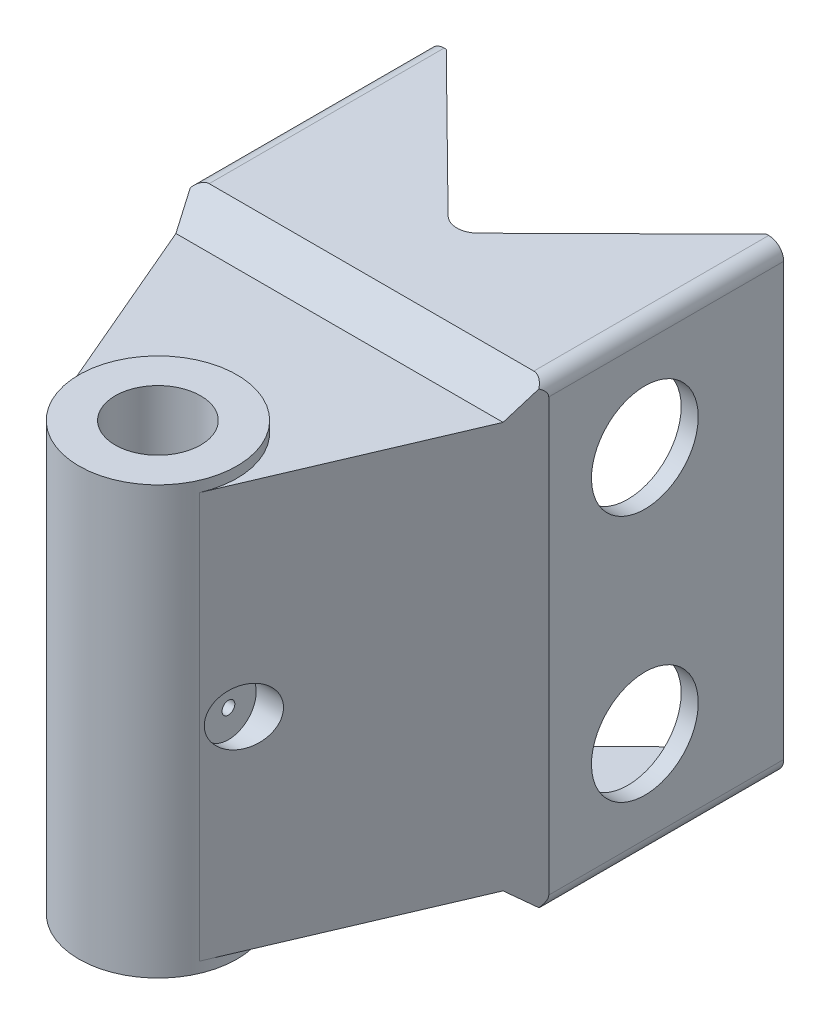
ISO-10303-21;
HEADER;
FILE_DESCRIPTION(('STEP AP214'),'2;1');
FILE_NAME('part.step','',(''),(''),'','','');
FILE_SCHEMA(('AUTOMOTIVE_DESIGN { 1 0 10303 214 1 1 1 1 }'));
ENDSEC;
DATA;
#1=APPLICATION_CONTEXT('core data for automotive mechanical design processes');
#2=APPLICATION_PROTOCOL_DEFINITION('international standard','automotive_design',2000,#1);
#3=PRODUCT_CONTEXT('',#1,'mechanical');
#4=PRODUCT('Part','Part','',(#3));
#5=PRODUCT_RELATED_PRODUCT_CATEGORY('part','',(#4));
#6=PRODUCT_DEFINITION_FORMATION('','',#4);
#7=PRODUCT_DEFINITION_CONTEXT('part definition',#1,'design');
#8=PRODUCT_DEFINITION('design','',#6,#7);
#9=PRODUCT_DEFINITION_SHAPE('','',#8);
#10=(LENGTH_UNIT() NAMED_UNIT(*) SI_UNIT(.MILLI.,.METRE.));
#11=(NAMED_UNIT(*) PLANE_ANGLE_UNIT() SI_UNIT($,.RADIAN.));
#12=(NAMED_UNIT(*) SI_UNIT($,.STERADIAN.) SOLID_ANGLE_UNIT());
#13=UNCERTAINTY_MEASURE_WITH_UNIT(LENGTH_MEASURE(1.E-05),#10,'distance_accuracy_value','');
#14=(GEOMETRIC_REPRESENTATION_CONTEXT(3) GLOBAL_UNCERTAINTY_ASSIGNED_CONTEXT((#13)) GLOBAL_UNIT_ASSIGNED_CONTEXT((#10,
#11,#12)) REPRESENTATION_CONTEXT('',''));
#15=CARTESIAN_POINT('',(0.,0.,0.));
#16=DIRECTION('',(0.,0.,1.));
#17=DIRECTION('',(1.,0.,0.));
#18=AXIS2_PLACEMENT_3D('',#15,#16,#17);
#19=CARTESIAN_POINT('',(0.,0.,210.));
#20=DIRECTION('',(1.,0.,0.));
#21=DIRECTION('',(0.,1.,0.));
#22=AXIS2_PLACEMENT_3D('',#19,#20,#21);
#23=CYLINDRICAL_SURFACE('',#22,2.99999999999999);
#24=CARTESIAN_POINT('',(20.,3.,210.));
#25=CARTESIAN_POINT('',(19.9999973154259,2.99999309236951,210.167503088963));
#26=CARTESIAN_POINT('',(19.9978736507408,2.98592399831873,210.335103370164));
#27=CARTESIAN_POINT('',(19.9896063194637,2.9300336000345,210.66561925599));
#28=CARTESIAN_POINT('',(19.9834587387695,2.88818527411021,210.828530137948));
#29=CARTESIAN_POINT('',(19.9678344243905,2.77801499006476,211.144836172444));
#30=CARTESIAN_POINT('',(19.9583602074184,2.70971304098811,211.298238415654));
#31=CARTESIAN_POINT('',(19.9371295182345,2.54862324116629,211.59138085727));
#32=CARTESIAN_POINT('',(19.9253733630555,2.45583879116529,211.73112294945));
#33=CARTESIAN_POINT('',(19.900783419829,2.24764547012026,211.994093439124));
#34=CARTESIAN_POINT('',(19.8879426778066,2.13208308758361,212.117199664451));
#35=CARTESIAN_POINT('',(19.8626852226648,1.88194462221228,212.342349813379));
#36=CARTESIAN_POINT('',(19.8502685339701,1.74736744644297,212.444392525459));
#37=CARTESIAN_POINT('',(19.8271975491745,1.46219871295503,212.624994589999));
#38=CARTESIAN_POINT('',(19.8165522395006,1.31153150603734,212.703435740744));
#39=CARTESIAN_POINT('',(19.7983242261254,0.998974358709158,212.833852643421));
#40=CARTESIAN_POINT('',(19.790741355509,0.837085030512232,212.885829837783));
#41=CARTESIAN_POINT('',(19.7795651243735,0.507963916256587,212.961463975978));
#42=CARTESIAN_POINT('',(19.775942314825,0.340781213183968,212.98533007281));
#43=CARTESIAN_POINT('',(19.7730069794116,0.0047476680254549,213.004712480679));
#44=CARTESIAN_POINT('',(19.7736942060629,-0.164103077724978,213.000230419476));
#45=CARTESIAN_POINT('',(19.7792743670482,-0.497202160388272,212.963214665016));
#46=CARTESIAN_POINT('',(19.784132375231,-0.661477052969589,212.930913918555));
#47=CARTESIAN_POINT('',(19.7974521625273,-0.982248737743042,212.839542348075));
#48=CARTESIAN_POINT('',(19.8059140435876,-1.13874530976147,212.780470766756));
#49=CARTESIAN_POINT('',(19.8255267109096,-1.44022674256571,212.636992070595));
#50=CARTESIAN_POINT('',(19.8366879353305,-1.58516393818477,212.552486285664));
#51=CARTESIAN_POINT('',(19.860434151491,-1.85888919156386,212.360608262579));
#52=CARTESIAN_POINT('',(19.87301923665,-1.98767618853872,212.25323452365));
#53=CARTESIAN_POINT('',(19.8983494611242,-2.22679532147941,212.017389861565));
#54=CARTESIAN_POINT('',(19.9110949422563,-2.33692998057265,211.888718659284));
#55=CARTESIAN_POINT('',(19.9351929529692,-2.5340718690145,211.614614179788));
#56=CARTESIAN_POINT('',(19.9465454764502,-2.62107899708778,211.469180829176));
#57=CARTESIAN_POINT('',(19.9665903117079,-2.76950617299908,211.165509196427));
#58=CARTESIAN_POINT('',(19.9752810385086,-2.83091098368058,211.007263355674));
#59=CARTESIAN_POINT('',(19.9890098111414,-2.92621877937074,210.682546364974));
#60=CARTESIAN_POINT('',(19.9940481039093,-2.96012362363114,210.516075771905));
#61=CARTESIAN_POINT('',(19.9998716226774,-2.99920645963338,210.181339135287));
#62=CARTESIAN_POINT('',(20.0006970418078,-3.00465594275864,210.013105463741));
#63=CARTESIAN_POINT('',(19.9981112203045,-2.98739398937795,209.678126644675));
#64=CARTESIAN_POINT('',(19.9947001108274,-2.9646834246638,209.511381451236));
#65=CARTESIAN_POINT('',(19.9840493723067,-2.89197179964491,209.184935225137));
#66=CARTESIAN_POINT('',(19.9768283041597,-2.8421030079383,209.02520407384));
#67=CARTESIAN_POINT('',(19.9593647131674,-2.71663000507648,208.716370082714));
#68=CARTESIAN_POINT('',(19.9491220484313,-2.64102458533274,208.56726774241));
#69=CARTESIAN_POINT('',(19.9266536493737,-2.46558755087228,208.282730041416));
#70=CARTESIAN_POINT('',(19.9144140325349,-2.36558371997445,208.147401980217));
#71=CARTESIAN_POINT('',(19.8893572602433,-2.1444283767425,207.895352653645));
#72=CARTESIAN_POINT('',(19.8765400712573,-2.0232756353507,207.778632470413));
#73=CARTESIAN_POINT('',(19.8516452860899,-1.76205293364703,207.566124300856));
#74=CARTESIAN_POINT('',(19.8395747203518,-1.62183414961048,207.470518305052));
#75=CARTESIAN_POINT('',(19.8176643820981,-1.32716791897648,207.304217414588));
#76=CARTESIAN_POINT('',(19.8078245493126,-1.17272085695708,207.233521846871));
#77=CARTESIAN_POINT('',(19.7915406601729,-0.854524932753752,207.119330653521));
#78=CARTESIAN_POINT('',(19.7850846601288,-0.69081107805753,207.075739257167));
#79=CARTESIAN_POINT('',(19.776267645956,-0.358281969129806,207.016689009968));
#80=CARTESIAN_POINT('',(19.7739063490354,-0.189467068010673,207.001228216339));
#81=CARTESIAN_POINT('',(19.7735566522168,0.146658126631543,206.998924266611));
#82=CARTESIAN_POINT('',(19.77552452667,0.313966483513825,207.011794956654));
#83=CARTESIAN_POINT('',(19.7835164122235,0.644010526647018,207.065175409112));
#84=CARTESIAN_POINT('',(19.7895404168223,0.806746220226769,207.105685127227));
#85=CARTESIAN_POINT('',(19.8049505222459,1.12294616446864,207.213092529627));
#86=CARTESIAN_POINT('',(19.8143340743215,1.27641734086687,207.279970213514));
#87=CARTESIAN_POINT('',(19.835409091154,1.5700072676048,207.438186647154));
#88=CARTESIAN_POINT('',(19.8471006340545,1.71012556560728,207.52952622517));
#89=CARTESIAN_POINT('',(19.8716148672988,1.97448611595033,207.735113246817));
#90=CARTESIAN_POINT('',(19.8844473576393,2.09856266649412,207.849572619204));
#91=CARTESIAN_POINT('',(19.9097157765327,2.32584910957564,208.097702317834));
#92=CARTESIAN_POINT('',(19.9221516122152,2.42905414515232,208.231377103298));
#93=CARTESIAN_POINT('',(19.9453037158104,2.61217535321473,208.515008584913));
#94=CARTESIAN_POINT('',(19.9560101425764,2.6919602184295,208.66505084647));
#95=CARTESIAN_POINT('',(19.9744005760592,2.82507703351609,208.976496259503));
#96=CARTESIAN_POINT('',(19.9820877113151,2.87843638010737,209.137887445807));
#97=CARTESIAN_POINT('',(19.9918187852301,2.94508268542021,209.416668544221));
#98=CARTESIAN_POINT('',(19.9948709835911,2.96564520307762,209.532337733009));
#99=CARTESIAN_POINT('',(19.9989625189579,2.99310619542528,209.7653220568));
#100=CARTESIAN_POINT('',(20.0000018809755,3.00000483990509,209.882637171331));
#101=CARTESIAN_POINT('',(20.,3.,210.));
#102=B_SPLINE_CURVE_WITH_KNOTS('',3,(#24,#25,#26,#27,#28,#29,#30,#31,#32,#33,#34,#35,#36,#37,
#38,#39,#40,#41,#42,#43,#44,#45,#46,#47,#48,#49,#50,#51,#52,#53,#54,#55,#56,#57,#58,#59,#60,#61,
#62,#63,#64,#65,#66,#67,#68,#69,#70,#71,#72,#73,#74,#75,#76,#77,#78,#79,#80,#81,#82,#83,#84,#85,
#86,#87,#88,#89,#90,#91,#92,#93,#94,#95,#96,#97,#98,#99,#100,#101),.UNSPECIFIED.,.T.,.F.,(4,2,2,
2,2,2,2,2,2,2,2,2,2,2,2,2,2,2,2,2,2,2,2,2,2,2,2,2,2,2,2,2,2,2,2,2,2,2,4),(0.,0.502080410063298,
1.00464992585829,1.50684004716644,2.00896044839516,2.51458832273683,3.02024527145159,
3.52839404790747,4.0365151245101,4.54083129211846,5.04511850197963,5.5452235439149,
6.04534273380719,6.54742766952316,7.04954556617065,7.55668582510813,8.06382830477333,
8.57127217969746,9.07868174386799,9.58124117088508,10.0837850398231,10.5839029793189,
11.0840444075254,11.5878237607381,12.0916324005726,12.5996273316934,13.1076085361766,
13.6137844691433,14.1199254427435,14.6209777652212,15.1220292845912,15.6227014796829,
16.1233906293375,16.6288965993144,17.1345200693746,17.6429264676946,18.1508046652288,
18.5025970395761,18.8543850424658),.UNSPECIFIED.);
#103=CARTESIAN_POINT('',(20.,3.,210.));
#104=VERTEX_POINT('',#103);
#105=EDGE_CURVE('E159',#104,#104,#102,.T.);
#106=ORIENTED_EDGE('',*,*,#105,.F.);
#107=EDGE_LOOP('',(#106));
#108=FACE_BOUND('',#107,.T.);
#109=CARTESIAN_POINT('',(33.,0.,210.));
#110=DIRECTION('',(1.,0.,0.));
#111=DIRECTION('',(0.,1.,0.));
#112=AXIS2_PLACEMENT_3D('',#109,#110,#111);
#113=CIRCLE('',#112,2.99999999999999);
#114=CARTESIAN_POINT('',(33.,3.,210.));
#115=VERTEX_POINT('',#114);
#116=EDGE_CURVE('E167',#115,#115,#113,.F.);
#117=ORIENTED_EDGE('',*,*,#116,.F.);
#118=EDGE_LOOP('',(#117));
#119=FACE_BOUND('',#118,.T.);
#120=ADVANCED_FACE('F43',(#108,#119),#23,.F.);
#121=CARTESIAN_POINT('',(-83.,108.,0.));
#122=DIRECTION('',(0.,0.,1.));
#123=DIRECTION('',(1.,0.,0.));
#124=AXIS2_PLACEMENT_3D('',#121,#122,#123);
#125=PLANE('',#124);
#126=DIRECTION('',(1.,0.,0.));
#127=VECTOR('',#126,1.);
#128=CARTESIAN_POINT('',(-83.,-108.,0.));
#129=LINE('',#128,#127);
#130=CARTESIAN_POINT('',(75.,-108.,0.));
#131=VERTEX_POINT('',#130);
#132=CARTESIAN_POINT('',(76.,-108.,0.));
#133=VERTEX_POINT('',#132);
#134=EDGE_CURVE('E413',#131,#133,#129,.T.);
#135=ORIENTED_EDGE('',*,*,#134,.F.);
#136=DIRECTION('',(0.,1.,0.));
#137=VECTOR('',#136,1.);
#138=CARTESIAN_POINT('',(75.,-108.,0.));
#139=LINE('',#138,#137);
#140=CARTESIAN_POINT('',(75.,-93.,0.));
#141=VERTEX_POINT('',#140);
#142=EDGE_CURVE('E707',#131,#141,#139,.T.);
#143=ORIENTED_EDGE('',*,*,#142,.T.);
#144=DIRECTION('',(0.,1.,0.));
#145=VECTOR('',#144,1.);
#146=CARTESIAN_POINT('',(75.,100.,0.));
#147=LINE('',#146,#145);
#148=CARTESIAN_POINT('',(75.,93.,0.));
#149=VERTEX_POINT('',#148);
#150=EDGE_CURVE('E394',#141,#149,#147,.T.);
#151=ORIENTED_EDGE('',*,*,#150,.T.);
#152=CARTESIAN_POINT('',(75.,108.,0.));
#153=VERTEX_POINT('',#152);
#154=EDGE_CURVE('E76',#149,#153,#139,.T.);
#155=ORIENTED_EDGE('',*,*,#154,.T.);
#156=DIRECTION('',(-1.,0.,0.));
#157=VECTOR('',#156,1.);
#158=CARTESIAN_POINT('',(-83.,108.,0.));
#159=LINE('',#158,#157);
#160=CARTESIAN_POINT('',(76.,108.,0.));
#161=VERTEX_POINT('',#160);
#162=EDGE_CURVE('E420',#161,#153,#159,.T.);
#163=ORIENTED_EDGE('',*,*,#162,.F.);
#164=CARTESIAN_POINT('',(76.,101.,0.));
#165=DIRECTION('',(0.,0.,1.));
#166=DIRECTION('',(1.,0.,0.));
#167=AXIS2_PLACEMENT_3D('',#164,#165,#166);
#168=CIRCLE('',#167,7.);
#169=CARTESIAN_POINT('',(83.,101.,0.));
#170=VERTEX_POINT('',#169);
#171=EDGE_CURVE('E556',#161,#170,#168,.F.);
#172=ORIENTED_EDGE('',*,*,#171,.T.);
#173=DIRECTION('',(0.,1.,0.));
#174=VECTOR('',#173,1.);
#175=CARTESIAN_POINT('',(83.,108.,0.));
#176=LINE('',#175,#174);
#177=CARTESIAN_POINT('',(83.,-101.,0.));
#178=VERTEX_POINT('',#177);
#179=EDGE_CURVE('E416',#178,#170,#176,.T.);
#180=ORIENTED_EDGE('',*,*,#179,.F.);
#181=CARTESIAN_POINT('',(76.,-101.,0.));
#182=DIRECTION('',(0.,0.,1.));
#183=DIRECTION('',(1.,0.,0.));
#184=AXIS2_PLACEMENT_3D('',#181,#182,#183);
#185=CIRCLE('',#184,7.);
#186=EDGE_CURVE('E553',#178,#133,#185,.F.);
#187=ORIENTED_EDGE('',*,*,#186,.T.);
#188=EDGE_LOOP('',(#135,#143,#151,#155,#163,#172,#180,#187));
#189=FACE_BOUND('',#188,.T.);
#190=ADVANCED_FACE('F176',(#189),#125,.F.);
#191=CARTESIAN_POINT('',(83.,-323.232432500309,110.));
#192=DIRECTION('',(0.,0.,-1.));
#193=DIRECTION('',(-1.,0.,0.));
#194=AXIS2_PLACEMENT_3D('',#191,#192,#193);
#195=PLANE('',#194);
#196=DIRECTION('',(0.,1.,0.));
#197=VECTOR('',#196,1.);
#198=CARTESIAN_POINT('',(-74.2993356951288,-262.799755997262,110.));
#199=LINE('',#198,#197);
#200=CARTESIAN_POINT('',(-74.2993356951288,-96.0526004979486,110.));
#201=VERTEX_POINT('',#200);
#202=CARTESIAN_POINT('',(-74.2993356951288,96.0526004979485,110.));
#203=VERTEX_POINT('',#202);
#204=EDGE_CURVE('E666',#201,#203,#199,.T.);
#205=ORIENTED_EDGE('',*,*,#204,.F.);
#206=CARTESIAN_POINT('',(-68.,-93.,110.));
#207=DIRECTION('',(0.,0.,-1.));
#208=DIRECTION('',(-1.,0.,0.));
#209=AXIS2_PLACEMENT_3D('',#206,#207,#208);
#210=CIRCLE('',#209,7.);
#211=CARTESIAN_POINT('',(-75.,-93.,110.));
#212=VERTEX_POINT('',#211);
#213=EDGE_CURVE('E143',#201,#212,#210,.T.);
#214=ORIENTED_EDGE('',*,*,#213,.T.);
#215=DIRECTION('',(0.,-1.,0.));
#216=VECTOR('',#215,1.);
#217=CARTESIAN_POINT('',(-75.,100.,110.));
#218=LINE('',#217,#216);
#219=CARTESIAN_POINT('',(-75.,93.,110.));
#220=VERTEX_POINT('',#219);
#221=EDGE_CURVE('E138',#220,#212,#218,.T.);
#222=ORIENTED_EDGE('',*,*,#221,.F.);
#223=CARTESIAN_POINT('',(-68.,93.,110.));
#224=DIRECTION('',(0.,0.,-1.));
#225=DIRECTION('',(-1.,0.,0.));
#226=AXIS2_PLACEMENT_3D('',#223,#224,#225);
#227=CIRCLE('',#226,7.);
#228=EDGE_CURVE('E535',#220,#203,#227,.T.);
#229=ORIENTED_EDGE('',*,*,#228,.T.);
#230=EDGE_LOOP('',(#205,#214,#222,#229));
#231=FACE_BOUND('',#230,.T.);
#232=ADVANCED_FACE('F818',(#231),#195,.T.);
#233=CARTESIAN_POINT('',(0.,-95.,210.));
#234=DIRECTION('',(0.,-1.,0.));
#235=DIRECTION('',(0.,0.,1.));
#236=AXIS2_PLACEMENT_3D('',#233,#234,#235);
#237=PLANE('',#236);
#238=DIRECTION('',(-1.,0.,0.));
#239=VECTOR('',#238,1.);
#240=CARTESIAN_POINT('',(102.849433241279,-95.,125.));
#241=LINE('',#240,#239);
#242=CARTESIAN_POINT('',(76.5860858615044,-95.,125.));
#243=VERTEX_POINT('',#242);
#244=CARTESIAN_POINT('',(-76.5860858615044,-95.,125.));
#245=VERTEX_POINT('',#244);
#246=EDGE_CURVE('E762',#243,#245,#241,.T.);
#247=ORIENTED_EDGE('',*,*,#246,.F.);
#248=DIRECTION('',(0.393160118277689,0.,-0.919470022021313));
#249=VECTOR('',#248,1.);
#250=CARTESIAN_POINT('',(34.0203908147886,-95.,224.546924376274));
#251=LINE('',#250,#249);
#252=CARTESIAN_POINT('',(34.0203908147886,-95.,224.546924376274));
#253=VERTEX_POINT('',#252);
#254=EDGE_CURVE('E628',#253,#243,#251,.T.);
#255=ORIENTED_EDGE('',*,*,#254,.F.);
#256=CARTESIAN_POINT('',(0.,-95.,210.));
#257=DIRECTION('',(0.,-1.,0.));
#258=DIRECTION('',(0.,0.,-1.));
#259=AXIS2_PLACEMENT_3D('',#256,#257,#258);
#260=CIRCLE('',#259,37.);
#261=CARTESIAN_POINT('',(-34.0203908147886,-95.,224.546924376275));
#262=VERTEX_POINT('',#261);
#263=EDGE_CURVE('E429',#253,#262,#260,.F.);
#264=ORIENTED_EDGE('',*,*,#263,.T.);
#265=DIRECTION('',(0.39316011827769,0.,0.919470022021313));
#266=VECTOR('',#265,1.);
#267=CARTESIAN_POINT('',(-83.,-95.,110.));
#268=LINE('',#267,#266);
#269=EDGE_CURVE('E313',#245,#262,#268,.T.);
#270=ORIENTED_EDGE('',*,*,#269,.F.);
#271=EDGE_LOOP('',(#247,#255,#264,#270));
#272=FACE_BOUND('',#271,.T.);
#273=ADVANCED_FACE('F815',(#272),#237,.T.);
#274=CARTESIAN_POINT('',(0.,95.,210.));
#275=DIRECTION('',(0.,1.,0.));
#276=DIRECTION('',(0.,0.,1.));
#277=AXIS2_PLACEMENT_3D('',#274,#275,#276);
#278=PLANE('',#277);
#279=DIRECTION('',(-1.,0.,0.));
#280=VECTOR('',#279,1.);
#281=CARTESIAN_POINT('',(102.849433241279,95.,125.));
#282=LINE('',#281,#280);
#283=CARTESIAN_POINT('',(76.5860858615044,95.,125.));
#284=VERTEX_POINT('',#283);
#285=CARTESIAN_POINT('',(-76.5860858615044,95.,125.));
#286=VERTEX_POINT('',#285);
#287=EDGE_CURVE('E760',#284,#286,#282,.T.);
#288=ORIENTED_EDGE('',*,*,#287,.T.);
#289=DIRECTION('',(0.39316011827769,0.,0.919470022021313));
#290=VECTOR('',#289,1.);
#291=CARTESIAN_POINT('',(-83.,95.,110.));
#292=LINE('',#291,#290);
#293=CARTESIAN_POINT('',(-34.0203908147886,95.,224.546924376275));
#294=VERTEX_POINT('',#293);
#295=EDGE_CURVE('E627',#286,#294,#292,.T.);
#296=ORIENTED_EDGE('',*,*,#295,.T.);
#297=CARTESIAN_POINT('',(0.,95.,210.));
#298=DIRECTION('',(0.,1.,0.));
#299=DIRECTION('',(0.,0.,1.));
#300=AXIS2_PLACEMENT_3D('',#297,#298,#299);
#301=CIRCLE('',#300,37.);
#302=CARTESIAN_POINT('',(34.0203908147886,95.,224.546924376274));
#303=VERTEX_POINT('',#302);
#304=EDGE_CURVE('E657',#303,#294,#301,.T.);
#305=ORIENTED_EDGE('',*,*,#304,.F.);
#306=DIRECTION('',(0.393160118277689,0.,-0.919470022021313));
#307=VECTOR('',#306,1.);
#308=CARTESIAN_POINT('',(34.0203908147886,95.,224.546924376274));
#309=LINE('',#308,#307);
#310=EDGE_CURVE('E631',#303,#284,#309,.T.);
#311=ORIENTED_EDGE('',*,*,#310,.T.);
#312=EDGE_LOOP('',(#288,#296,#305,#311));
#313=FACE_BOUND('',#312,.T.);
#314=ADVANCED_FACE('F817',(#313),#278,.T.);
#315=CARTESIAN_POINT('',(83.,-323.232432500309,110.));
#316=DIRECTION('',(0.919470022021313,0.,0.39316011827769));
#317=DIRECTION('',(0.39316011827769,0.,-0.919470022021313));
#318=AXIS2_PLACEMENT_3D('',#315,#316,#317);
#319=PLANE('',#318);
#320=CARTESIAN_POINT('',(40.2405724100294,0.,210.));
#321=DIRECTION('',(0.919470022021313,0.,0.39316011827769));
#322=DIRECTION('',(0.39316011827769,0.,-0.919470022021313));
#323=AXIS2_PLACEMENT_3D('',#320,#321,#322);
#324=ELLIPSE('',#323,14.1385794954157,13.);
#325=CARTESIAN_POINT('',(45.7992979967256,0.,197.));
#326=VERTEX_POINT('',#325);
#327=EDGE_CURVE('E47',#326,#326,#324,.T.);
#328=ORIENTED_EDGE('',*,*,#327,.F.);
#329=EDGE_LOOP('',(#328));
#330=FACE_BOUND('',#329,.T.);
#331=DIRECTION('',(0.,1.,0.));
#332=VECTOR('',#331,1.);
#333=CARTESIAN_POINT('',(83.,108.,110.));
#334=LINE('',#333,#332);
#335=CARTESIAN_POINT('',(83.,-101.,110.));
#336=VERTEX_POINT('',#335);
#337=CARTESIAN_POINT('',(83.,101.,110.));
#338=VERTEX_POINT('',#337);
#339=EDGE_CURVE('E426',#336,#338,#334,.T.);
#340=ORIENTED_EDGE('',*,*,#339,.T.);
#341=CARTESIAN_POINT('',(76.,101.,126.37065881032));
#342=DIRECTION('',(0.919470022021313,0.,0.39316011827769));
#343=DIRECTION('',(0.39316011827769,0.,-0.919470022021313));
#344=AXIS2_PLACEMENT_3D('',#341,#342,#343);
#345=ELLIPSE('',#344,17.8044508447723,7.);
#346=CARTESIAN_POINT('',(81.611171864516,105.185062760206,113.248004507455));
#347=VERTEX_POINT('',#346);
#348=EDGE_CURVE('E566',#338,#347,#345,.T.);
#349=ORIENTED_EDGE('',*,*,#348,.T.);
#350=DIRECTION('',(-0.307474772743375,-0.623203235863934,0.719080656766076));
#351=VECTOR('',#350,1.);
#352=CARTESIAN_POINT('',(84.8765800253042,111.803533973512,105.61130695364));
#353=LINE('',#352,#351);
#354=EDGE_CURVE('E618',#347,#284,#353,.T.);
#355=ORIENTED_EDGE('',*,*,#354,.T.);
#356=ORIENTED_EDGE('',*,*,#310,.F.);
#357=DIRECTION('',(0.,1.,0.));
#358=VECTOR('',#357,1.);
#359=CARTESIAN_POINT('',(34.0203908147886,-323.232432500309,224.546924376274));
#360=LINE('',#359,#358);
#361=EDGE_CURVE('E395',#253,#303,#360,.T.);
#362=ORIENTED_EDGE('',*,*,#361,.F.);
#363=ORIENTED_EDGE('',*,*,#254,.T.);
#364=DIRECTION('',(0.307474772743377,-0.623203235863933,-0.719080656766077));
#365=VECTOR('',#364,1.);
#366=CARTESIAN_POINT('',(84.8765800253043,-111.803533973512,105.61130695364));
#367=LINE('',#366,#365);
#368=CARTESIAN_POINT('',(81.611171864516,-105.185062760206,113.248004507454));
#369=VERTEX_POINT('',#368);
#370=EDGE_CURVE('E758',#243,#369,#367,.T.);
#371=ORIENTED_EDGE('',*,*,#370,.T.);
#372=CARTESIAN_POINT('',(76.,-101.,126.37065881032));
#373=DIRECTION('',(0.919470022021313,0.,0.39316011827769));
#374=DIRECTION('',(0.39316011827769,0.,-0.919470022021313));
#375=AXIS2_PLACEMENT_3D('',#372,#373,#374);
#376=ELLIPSE('',#375,17.8044508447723,7.);
#377=EDGE_CURVE('E323',#369,#336,#376,.T.);
#378=ORIENTED_EDGE('',*,*,#377,.T.);
#379=EDGE_LOOP('',(#340,#349,#355,#356,#362,#363,#371,#378));
#380=FACE_BOUND('',#379,.T.);
#381=ADVANCED_FACE('F602',(#330,#380),#319,.T.);
#382=CARTESIAN_POINT('',(0.,-323.232432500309,210.));
#383=DIRECTION('',(0.,1.,0.));
#384=DIRECTION('',(0.,0.,1.));
#385=AXIS2_PLACEMENT_3D('',#382,#383,#384);
#386=CYLINDRICAL_SURFACE('',#385,37.);
#387=DIRECTION('',(0.,1.,0.));
#388=VECTOR('',#387,1.);
#389=CARTESIAN_POINT('',(-34.0203908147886,-323.232432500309,224.546924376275));
#390=LINE('',#389,#388);
#391=EDGE_CURVE('E400',#262,#294,#390,.T.);
#392=ORIENTED_EDGE('',*,*,#391,.F.);
#393=ORIENTED_EDGE('',*,*,#263,.F.);
#394=ORIENTED_EDGE('',*,*,#361,.T.);
#395=ORIENTED_EDGE('',*,*,#304,.T.);
#396=EDGE_LOOP('',(#392,#393,#394,#395));
#397=FACE_BOUND('',#396,.T.);
#398=CARTESIAN_POINT('',(0.,100.,210.));
#399=DIRECTION('',(0.,1.,0.));
#400=DIRECTION('',(0.,0.,1.));
#401=AXIS2_PLACEMENT_3D('',#398,#399,#400);
#402=CIRCLE('',#401,37.);
#403=CARTESIAN_POINT('',(0.,100.,247.));
#404=VERTEX_POINT('',#403);
#405=EDGE_CURVE('E662',#404,#404,#402,.T.);
#406=ORIENTED_EDGE('',*,*,#405,.F.);
#407=EDGE_LOOP('',(#406));
#408=FACE_BOUND('',#407,.T.);
#409=CARTESIAN_POINT('',(0.,-100.,210.));
#410=DIRECTION('',(0.,-1.,0.));
#411=DIRECTION('',(0.,0.,-1.));
#412=AXIS2_PLACEMENT_3D('',#409,#410,#411);
#413=CIRCLE('',#412,37.);
#414=CARTESIAN_POINT('',(0.,-100.,173.));
#415=VERTEX_POINT('',#414);
#416=EDGE_CURVE('E663',#415,#415,#413,.T.);
#417=ORIENTED_EDGE('',*,*,#416,.F.);
#418=EDGE_LOOP('',(#417));
#419=FACE_BOUND('',#418,.T.);
#420=ADVANCED_FACE('F658',(#397,#408,#419),#386,.T.);
#421=CARTESIAN_POINT('',(-83.,-323.232432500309,110.));
#422=DIRECTION('',(-0.919470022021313,0.,0.39316011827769));
#423=DIRECTION('',(0.393160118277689,0.,0.919470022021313));
#424=AXIS2_PLACEMENT_3D('',#421,#422,#423);
#425=PLANE('',#424);
#426=DIRECTION('',(0.,-1.,0.));
#427=VECTOR('',#426,1.);
#428=CARTESIAN_POINT('',(-83.,108.,110.));
#429=LINE('',#428,#427);
#430=CARTESIAN_POINT('',(-83.,101.,110.));
#431=VERTEX_POINT('',#430);
#432=CARTESIAN_POINT('',(-83.,-101.,110.));
#433=VERTEX_POINT('',#432);
#434=EDGE_CURVE('E423',#431,#433,#429,.T.);
#435=ORIENTED_EDGE('',*,*,#434,.T.);
#436=CARTESIAN_POINT('',(-76.,-101.,126.37065881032));
#437=DIRECTION('',(-0.919470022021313,0.,0.39316011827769));
#438=DIRECTION('',(-0.393160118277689,0.,-0.919470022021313));
#439=AXIS2_PLACEMENT_3D('',#436,#437,#438);
#440=ELLIPSE('',#439,17.8044508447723,7.);
#441=CARTESIAN_POINT('',(-81.611171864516,-105.185062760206,113.248004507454));
#442=VERTEX_POINT('',#441);
#443=EDGE_CURVE('E337',#433,#442,#440,.T.);
#444=ORIENTED_EDGE('',*,*,#443,.T.);
#445=DIRECTION('',(0.307474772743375,0.623203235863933,0.719080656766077));
#446=VECTOR('',#445,1.);
#447=CARTESIAN_POINT('',(-65.4296578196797,-72.3876666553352,151.091153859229));
#448=LINE('',#447,#446);
#449=EDGE_CURVE('E449',#442,#245,#448,.T.);
#450=ORIENTED_EDGE('',*,*,#449,.T.);
#451=ORIENTED_EDGE('',*,*,#269,.T.);
#452=ORIENTED_EDGE('',*,*,#391,.T.);
#453=ORIENTED_EDGE('',*,*,#295,.F.);
#454=DIRECTION('',(-0.307474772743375,0.623203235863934,-0.719080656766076));
#455=VECTOR('',#454,1.);
#456=CARTESIAN_POINT('',(-65.4296578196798,72.3876666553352,151.091153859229));
#457=LINE('',#456,#455);
#458=CARTESIAN_POINT('',(-81.611171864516,105.185062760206,113.248004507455));
#459=VERTEX_POINT('',#458);
#460=EDGE_CURVE('E452',#286,#459,#457,.T.);
#461=ORIENTED_EDGE('',*,*,#460,.T.);
#462=CARTESIAN_POINT('',(-76.,101.,126.37065881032));
#463=DIRECTION('',(-0.919470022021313,0.,0.39316011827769));
#464=DIRECTION('',(-0.393160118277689,0.,-0.919470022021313));
#465=AXIS2_PLACEMENT_3D('',#462,#463,#464);
#466=ELLIPSE('',#465,17.8044508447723,7.);
#467=EDGE_CURVE('E334',#459,#431,#466,.T.);
#468=ORIENTED_EDGE('',*,*,#467,.T.);
#469=EDGE_LOOP('',(#435,#444,#450,#451,#452,#453,#461,#468));
#470=FACE_BOUND('',#469,.T.);
#471=ADVANCED_FACE('F650',(#470),#425,.T.);
#472=CARTESIAN_POINT('',(-83.,-108.,110.));
#473=DIRECTION('',(0.,1.,0.));
#474=DIRECTION('',(-1.,0.,0.));
#475=AXIS2_PLACEMENT_3D('',#472,#473,#474);
#476=PLANE('',#475);
#477=CARTESIAN_POINT('',(0.,-108.,59.9999999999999));
#478=DIRECTION('',(0.,1.,0.));
#479=DIRECTION('',(0.,0.,-1.));
#480=AXIS2_PLACEMENT_3D('',#477,#478,#479);
#481=CIRCLE('',#480,10.);
#482=CARTESIAN_POINT('',(-7.02600753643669,-108.,67.1158427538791));
#483=VERTEX_POINT('',#482);
#484=CARTESIAN_POINT('',(7.02600753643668,-108.,67.1158427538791));
#485=VERTEX_POINT('',#484);
#486=EDGE_CURVE('E1057',#483,#485,#481,.T.);
#487=ORIENTED_EDGE('',*,*,#486,.T.);
#488=DIRECTION('',(0.711584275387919,0.,-0.702600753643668));
#489=VECTOR('',#488,1.);
#490=CARTESIAN_POINT('',(75.,-108.,0.));
#491=LINE('',#490,#489);
#492=EDGE_CURVE('E583',#485,#131,#491,.T.);
#493=ORIENTED_EDGE('',*,*,#492,.T.);
#494=ORIENTED_EDGE('',*,*,#134,.T.);
#495=DIRECTION('',(0.,0.,-1.));
#496=VECTOR('',#495,1.);
#497=CARTESIAN_POINT('',(76.,-108.,110.));
#498=LINE('',#497,#496);
#499=CARTESIAN_POINT('',(76.,-108.,110.));
#500=VERTEX_POINT('',#499);
#501=EDGE_CURVE('E320',#133,#500,#498,.F.);
#502=ORIENTED_EDGE('',*,*,#501,.T.);
#503=DIRECTION('',(-1.,0.,0.));
#504=VECTOR('',#503,1.);
#505=CARTESIAN_POINT('',(83.,-108.,110.));
#506=LINE('',#505,#504);
#507=CARTESIAN_POINT('',(-76.,-108.,110.));
#508=VERTEX_POINT('',#507);
#509=EDGE_CURVE('E297',#500,#508,#506,.T.);
#510=ORIENTED_EDGE('',*,*,#509,.T.);
#511=DIRECTION('',(0.,0.,-1.));
#512=VECTOR('',#511,1.);
#513=CARTESIAN_POINT('',(-76.,-108.,110.));
#514=LINE('',#513,#512);
#515=CARTESIAN_POINT('',(-76.,-108.,0.));
#516=VERTEX_POINT('',#515);
#517=EDGE_CURVE('E575',#508,#516,#514,.T.);
#518=ORIENTED_EDGE('',*,*,#517,.T.);
#519=CARTESIAN_POINT('',(-75.,-108.,0.));
#520=VERTEX_POINT('',#519);
#521=EDGE_CURVE('E414',#516,#520,#129,.T.);
#522=ORIENTED_EDGE('',*,*,#521,.T.);
#523=DIRECTION('',(0.711584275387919,0.,0.702600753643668));
#524=VECTOR('',#523,1.);
#525=CARTESIAN_POINT('',(-7.02600753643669,-108.,67.1158427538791));
#526=LINE('',#525,#524);
#527=EDGE_CURVE('E1055',#520,#483,#526,.T.);
#528=ORIENTED_EDGE('',*,*,#527,.T.);
#529=EDGE_LOOP('',(#487,#493,#494,#502,#510,#518,#522,#528));
#530=FACE_BOUND('',#529,.T.);
#531=ADVANCED_FACE('F578',(#530),#476,.F.);
#532=DIRECTION('',(0.,1.,0.));
#533=VECTOR('',#532,1.);
#534=CARTESIAN_POINT('',(74.2993356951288,-262.799755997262,110.));
#535=LINE('',#534,#533);
#536=CARTESIAN_POINT('',(74.2993356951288,-96.0526004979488,110.));
#537=VERTEX_POINT('',#536);
#538=CARTESIAN_POINT('',(74.2993356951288,96.0526004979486,110.));
#539=VERTEX_POINT('',#538);
#540=EDGE_CURVE('E314',#537,#539,#535,.T.);
#541=ORIENTED_EDGE('',*,*,#540,.T.);
#542=CARTESIAN_POINT('',(68.,93.,110.));
#543=DIRECTION('',(0.,0.,-1.));
#544=DIRECTION('',(-1.,0.,0.));
#545=AXIS2_PLACEMENT_3D('',#542,#543,#544);
#546=CIRCLE('',#545,7.);
#547=CARTESIAN_POINT('',(75.,93.,110.));
#548=VERTEX_POINT('',#547);
#549=EDGE_CURVE('E369',#539,#548,#546,.T.);
#550=ORIENTED_EDGE('',*,*,#549,.T.);
#551=DIRECTION('',(0.,1.,0.));
#552=VECTOR('',#551,1.);
#553=CARTESIAN_POINT('',(75.,100.,110.));
#554=LINE('',#553,#552);
#555=CARTESIAN_POINT('',(75.,-93.,110.));
#556=VERTEX_POINT('',#555);
#557=EDGE_CURVE('E137',#556,#548,#554,.T.);
#558=ORIENTED_EDGE('',*,*,#557,.F.);
#559=CARTESIAN_POINT('',(68.,-93.,110.));
#560=DIRECTION('',(0.,0.,-1.));
#561=DIRECTION('',(-1.,0.,0.));
#562=AXIS2_PLACEMENT_3D('',#559,#560,#561);
#563=CIRCLE('',#562,7.);
#564=EDGE_CURVE('E517',#556,#537,#563,.T.);
#565=ORIENTED_EDGE('',*,*,#564,.T.);
#566=EDGE_LOOP('',(#541,#550,#558,#565));
#567=FACE_BOUND('',#566,.T.);
#568=ADVANCED_FACE('F690',(#567),#195,.T.);
#569=CARTESIAN_POINT('',(-75.,108.,0.));
#570=VERTEX_POINT('',#569);
#571=CARTESIAN_POINT('',(-76.,108.,0.));
#572=VERTEX_POINT('',#571);
#573=EDGE_CURVE('E419',#570,#572,#159,.T.);
#574=ORIENTED_EDGE('',*,*,#573,.F.);
#575=DIRECTION('',(0.,1.,0.));
#576=VECTOR('',#575,1.);
#577=CARTESIAN_POINT('',(-75.,-108.,0.));
#578=LINE('',#577,#576);
#579=CARTESIAN_POINT('',(-75.,93.,0.));
#580=VERTEX_POINT('',#579);
#581=EDGE_CURVE('E393',#580,#570,#578,.T.);
#582=ORIENTED_EDGE('',*,*,#581,.F.);
#583=DIRECTION('',(0.,-1.,0.));
#584=VECTOR('',#583,1.);
#585=CARTESIAN_POINT('',(-75.,100.,0.));
#586=LINE('',#585,#584);
#587=CARTESIAN_POINT('',(-75.,-93.,0.));
#588=VERTEX_POINT('',#587);
#589=EDGE_CURVE('E379',#580,#588,#586,.T.);
#590=ORIENTED_EDGE('',*,*,#589,.T.);
#591=EDGE_CURVE('E390',#520,#588,#578,.T.);
#592=ORIENTED_EDGE('',*,*,#591,.F.);
#593=ORIENTED_EDGE('',*,*,#521,.F.);
#594=CARTESIAN_POINT('',(-76.,-101.,0.));
#595=DIRECTION('',(0.,0.,1.));
#596=DIRECTION('',(1.,0.,0.));
#597=AXIS2_PLACEMENT_3D('',#594,#595,#596);
#598=CIRCLE('',#597,7.);
#599=CARTESIAN_POINT('',(-83.,-101.,0.));
#600=VERTEX_POINT('',#599);
#601=EDGE_CURVE('E550',#516,#600,#598,.F.);
#602=ORIENTED_EDGE('',*,*,#601,.T.);
#603=DIRECTION('',(0.,-1.,0.));
#604=VECTOR('',#603,1.);
#605=CARTESIAN_POINT('',(-83.,108.,0.));
#606=LINE('',#605,#604);
#607=CARTESIAN_POINT('',(-83.,101.,0.));
#608=VERTEX_POINT('',#607);
#609=EDGE_CURVE('E410',#608,#600,#606,.T.);
#610=ORIENTED_EDGE('',*,*,#609,.F.);
#611=CARTESIAN_POINT('',(-76.,101.,0.));
#612=DIRECTION('',(0.,0.,1.));
#613=DIRECTION('',(1.,0.,0.));
#614=AXIS2_PLACEMENT_3D('',#611,#612,#613);
#615=CIRCLE('',#614,7.);
#616=EDGE_CURVE('E547',#608,#572,#615,.F.);
#617=ORIENTED_EDGE('',*,*,#616,.T.);
#618=EDGE_LOOP('',(#574,#582,#590,#592,#593,#602,#610,#617));
#619=FACE_BOUND('',#618,.T.);
#620=ADVANCED_FACE('F387',(#619),#125,.F.);
#621=CARTESIAN_POINT('',(-83.,108.,110.));
#622=DIRECTION('',(1.,0.,0.));
#623=DIRECTION('',(0.,1.,0.));
#624=AXIS2_PLACEMENT_3D('',#621,#622,#623);
#625=PLANE('',#624);
#626=CARTESIAN_POINT('',(-83.,58.,65.));
#627=DIRECTION('',(1.,0.,0.));
#628=DIRECTION('',(0.,1.,0.));
#629=AXIS2_PLACEMENT_3D('',#626,#627,#628);
#630=CIRCLE('',#629,25.);
#631=CARTESIAN_POINT('',(-83.,83.,65.));
#632=VERTEX_POINT('',#631);
#633=EDGE_CURVE('E158',#632,#632,#630,.T.);
#634=ORIENTED_EDGE('',*,*,#633,.T.);
#635=EDGE_LOOP('',(#634));
#636=FACE_BOUND('',#635,.T.);
#637=CARTESIAN_POINT('',(-83.,-58.,65.));
#638=DIRECTION('',(1.,0.,0.));
#639=DIRECTION('',(0.,1.,0.));
#640=AXIS2_PLACEMENT_3D('',#637,#638,#639);
#641=CIRCLE('',#640,25.);
#642=CARTESIAN_POINT('',(-83.,-33.,65.));
#643=VERTEX_POINT('',#642);
#644=EDGE_CURVE('E153',#643,#643,#641,.T.);
#645=ORIENTED_EDGE('',*,*,#644,.T.);
#646=EDGE_LOOP('',(#645));
#647=FACE_BOUND('',#646,.T.);
#648=ORIENTED_EDGE('',*,*,#609,.T.);
#649=DIRECTION('',(0.,0.,-1.));
#650=VECTOR('',#649,1.);
#651=CARTESIAN_POINT('',(-83.,-101.,110.));
#652=LINE('',#651,#650);
#653=EDGE_CURVE('E327',#600,#433,#652,.F.);
#654=ORIENTED_EDGE('',*,*,#653,.T.);
#655=ORIENTED_EDGE('',*,*,#434,.F.);
#656=DIRECTION('',(0.,0.,-1.));
#657=VECTOR('',#656,1.);
#658=CARTESIAN_POINT('',(-83.,101.,110.));
#659=LINE('',#658,#657);
#660=EDGE_CURVE('E324',#431,#608,#659,.T.);
#661=ORIENTED_EDGE('',*,*,#660,.T.);
#662=EDGE_LOOP('',(#648,#654,#655,#661));
#663=FACE_BOUND('',#662,.T.);
#664=ADVANCED_FACE('F45',(#636,#647,#663),#625,.F.);
#665=CARTESIAN_POINT('',(83.,108.,110.));
#666=DIRECTION('',(-1.,0.,0.));
#667=DIRECTION('',(0.,-1.,0.));
#668=AXIS2_PLACEMENT_3D('',#665,#666,#667);
#669=PLANE('',#668);
#670=CARTESIAN_POINT('',(83.,58.,65.));
#671=DIRECTION('',(1.,0.,0.));
#672=DIRECTION('',(0.,1.,0.));
#673=AXIS2_PLACEMENT_3D('',#670,#671,#672);
#674=CIRCLE('',#673,25.);
#675=CARTESIAN_POINT('',(83.,83.,65.));
#676=VERTEX_POINT('',#675);
#677=EDGE_CURVE('E166',#676,#676,#674,.T.);
#678=ORIENTED_EDGE('',*,*,#677,.F.);
#679=EDGE_LOOP('',(#678));
#680=FACE_BOUND('',#679,.T.);
#681=CARTESIAN_POINT('',(83.,-58.,65.));
#682=DIRECTION('',(1.,0.,0.));
#683=DIRECTION('',(0.,1.,0.));
#684=AXIS2_PLACEMENT_3D('',#681,#682,#683);
#685=CIRCLE('',#684,25.);
#686=CARTESIAN_POINT('',(83.,-33.,65.));
#687=VERTEX_POINT('',#686);
#688=EDGE_CURVE('E1040',#687,#687,#685,.T.);
#689=ORIENTED_EDGE('',*,*,#688,.F.);
#690=EDGE_LOOP('',(#689));
#691=FACE_BOUND('',#690,.T.);
#692=ORIENTED_EDGE('',*,*,#179,.T.);
#693=DIRECTION('',(0.,0.,-1.));
#694=VECTOR('',#693,1.);
#695=CARTESIAN_POINT('',(83.,101.,110.));
#696=LINE('',#695,#694);
#697=EDGE_CURVE('E562',#170,#338,#696,.F.);
#698=ORIENTED_EDGE('',*,*,#697,.T.);
#699=ORIENTED_EDGE('',*,*,#339,.F.);
#700=DIRECTION('',(0.,0.,-1.));
#701=VECTOR('',#700,1.);
#702=CARTESIAN_POINT('',(83.,-101.,110.));
#703=LINE('',#702,#701);
#704=EDGE_CURVE('E559',#336,#178,#703,.T.);
#705=ORIENTED_EDGE('',*,*,#704,.T.);
#706=EDGE_LOOP('',(#692,#698,#699,#705));
#707=FACE_BOUND('',#706,.T.);
#708=ADVANCED_FACE('F596',(#680,#691,#707),#669,.F.);
#709=CARTESIAN_POINT('',(-83.,108.,110.));
#710=DIRECTION('',(0.,-1.,0.));
#711=DIRECTION('',(0.,0.,-1.));
#712=AXIS2_PLACEMENT_3D('',#709,#710,#711);
#713=PLANE('',#712);
#714=ORIENTED_EDGE('',*,*,#162,.T.);
#715=DIRECTION('',(0.711584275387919,0.,-0.702600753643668));
#716=VECTOR('',#715,1.);
#717=CARTESIAN_POINT('',(75.,108.,0.));
#718=LINE('',#717,#716);
#719=CARTESIAN_POINT('',(7.02600753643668,108.,67.1158427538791));
#720=VERTEX_POINT('',#719);
#721=EDGE_CURVE('E1053',#720,#153,#718,.T.);
#722=ORIENTED_EDGE('',*,*,#721,.F.);
#723=CARTESIAN_POINT('',(0.,108.,59.9999999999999));
#724=DIRECTION('',(0.,1.,0.));
#725=DIRECTION('',(0.,0.,-1.));
#726=AXIS2_PLACEMENT_3D('',#723,#724,#725);
#727=CIRCLE('',#726,10.);
#728=CARTESIAN_POINT('',(-7.02600753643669,108.,67.1158427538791));
#729=VERTEX_POINT('',#728);
#730=EDGE_CURVE('E1050',#729,#720,#727,.T.);
#731=ORIENTED_EDGE('',*,*,#730,.F.);
#732=DIRECTION('',(0.711584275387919,0.,0.702600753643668));
#733=VECTOR('',#732,1.);
#734=CARTESIAN_POINT('',(-7.02600753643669,108.,67.1158427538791));
#735=LINE('',#734,#733);
#736=EDGE_CURVE('E1047',#570,#729,#735,.T.);
#737=ORIENTED_EDGE('',*,*,#736,.F.);
#738=ORIENTED_EDGE('',*,*,#573,.T.);
#739=DIRECTION('',(0.,0.,-1.));
#740=VECTOR('',#739,1.);
#741=CARTESIAN_POINT('',(-76.,108.,110.));
#742=LINE('',#741,#740);
#743=CARTESIAN_POINT('',(-76.,108.,110.));
#744=VERTEX_POINT('',#743);
#745=EDGE_CURVE('E541',#572,#744,#742,.F.);
#746=ORIENTED_EDGE('',*,*,#745,.T.);
#747=DIRECTION('',(-1.,0.,0.));
#748=VECTOR('',#747,1.);
#749=CARTESIAN_POINT('',(83.,108.,110.));
#750=LINE('',#749,#748);
#751=CARTESIAN_POINT('',(76.,108.,110.));
#752=VERTEX_POINT('',#751);
#753=EDGE_CURVE('E615',#752,#744,#750,.T.);
#754=ORIENTED_EDGE('',*,*,#753,.F.);
#755=DIRECTION('',(0.,0.,-1.));
#756=VECTOR('',#755,1.);
#757=CARTESIAN_POINT('',(76.,108.,110.));
#758=LINE('',#757,#756);
#759=EDGE_CURVE('E544',#752,#161,#758,.T.);
#760=ORIENTED_EDGE('',*,*,#759,.T.);
#761=EDGE_LOOP('',(#714,#722,#731,#737,#738,#746,#754,#760));
#762=FACE_BOUND('',#761,.T.);
#763=ADVANCED_FACE('F622',(#762),#713,.F.);
#764=CARTESIAN_POINT('',(-75.,100.,110.));
#765=DIRECTION('',(1.,0.,0.));
#766=DIRECTION('',(0.,1.,0.));
#767=AXIS2_PLACEMENT_3D('',#764,#765,#766);
#768=PLANE('',#767);
#769=CARTESIAN_POINT('',(-75.,58.,65.));
#770=DIRECTION('',(1.,0.,0.));
#771=DIRECTION('',(0.,1.,0.));
#772=AXIS2_PLACEMENT_3D('',#769,#770,#771);
#773=CIRCLE('',#772,25.);
#774=CARTESIAN_POINT('',(-75.,83.,65.));
#775=VERTEX_POINT('',#774);
#776=EDGE_CURVE('E157',#775,#775,#773,.T.);
#777=ORIENTED_EDGE('',*,*,#776,.F.);
#778=EDGE_LOOP('',(#777));
#779=FACE_BOUND('',#778,.T.);
#780=CARTESIAN_POINT('',(-75.,-58.,65.));
#781=DIRECTION('',(1.,0.,0.));
#782=DIRECTION('',(0.,1.,0.));
#783=AXIS2_PLACEMENT_3D('',#780,#781,#782);
#784=CIRCLE('',#783,25.);
#785=CARTESIAN_POINT('',(-75.,-33.,65.));
#786=VERTEX_POINT('',#785);
#787=EDGE_CURVE('E152',#786,#786,#784,.T.);
#788=ORIENTED_EDGE('',*,*,#787,.F.);
#789=EDGE_LOOP('',(#788));
#790=FACE_BOUND('',#789,.T.);
#791=ORIENTED_EDGE('',*,*,#221,.T.);
#792=DIRECTION('',(0.,0.,-1.));
#793=VECTOR('',#792,1.);
#794=CARTESIAN_POINT('',(-75.,-93.,0.));
#795=LINE('',#794,#793);
#796=EDGE_CURVE('E128',#212,#588,#795,.T.);
#797=ORIENTED_EDGE('',*,*,#796,.T.);
#798=ORIENTED_EDGE('',*,*,#589,.F.);
#799=DIRECTION('',(0.,0.,-1.));
#800=VECTOR('',#799,1.);
#801=CARTESIAN_POINT('',(-75.,93.,110.));
#802=LINE('',#801,#800);
#803=EDGE_CURVE('E533',#580,#220,#802,.F.);
#804=ORIENTED_EDGE('',*,*,#803,.T.);
#805=EDGE_LOOP('',(#791,#797,#798,#804));
#806=FACE_BOUND('',#805,.T.);
#807=ADVANCED_FACE('F376',(#779,#790,#806),#768,.T.);
#808=CARTESIAN_POINT('',(-75.,-100.,110.));
#809=DIRECTION('',(0.,1.,0.));
#810=DIRECTION('',(0.,0.,1.));
#811=AXIS2_PLACEMENT_3D('',#808,#809,#810);
#812=PLANE('',#811);
#813=DIRECTION('',(0.711584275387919,0.,0.702600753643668));
#814=VECTOR('',#813,1.);
#815=CARTESIAN_POINT('',(-20.0044387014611,-100.,54.3012600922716));
#816=LINE('',#815,#814);
#817=CARTESIAN_POINT('',(-68.,-100.,6.91162725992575));
#818=VERTEX_POINT('',#817);
#819=CARTESIAN_POINT('',(-7.02600753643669,-100.,67.1158427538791));
#820=VERTEX_POINT('',#819);
#821=EDGE_CURVE('E123',#818,#820,#816,.T.);
#822=ORIENTED_EDGE('',*,*,#821,.F.);
#823=DIRECTION('',(0.,0.,-1.));
#824=VECTOR('',#823,1.);
#825=CARTESIAN_POINT('',(-68.,-100.,110.));
#826=LINE('',#825,#824);
#827=CARTESIAN_POINT('',(-68.,-100.,110.));
#828=VERTEX_POINT('',#827);
#829=EDGE_CURVE('E114',#818,#828,#826,.F.);
#830=ORIENTED_EDGE('',*,*,#829,.T.);
#831=DIRECTION('',(1.,0.,0.));
#832=VECTOR('',#831,1.);
#833=CARTESIAN_POINT('',(-75.,-100.,110.));
#834=LINE('',#833,#832);
#835=CARTESIAN_POINT('',(68.,-100.,110.));
#836=VERTEX_POINT('',#835);
#837=EDGE_CURVE('E119',#828,#836,#834,.T.);
#838=ORIENTED_EDGE('',*,*,#837,.T.);
#839=DIRECTION('',(0.,0.,-1.));
#840=VECTOR('',#839,1.);
#841=CARTESIAN_POINT('',(68.,-100.,0.));
#842=LINE('',#841,#840);
#843=CARTESIAN_POINT('',(68.,-100.,6.91162725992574));
#844=VERTEX_POINT('',#843);
#845=EDGE_CURVE('E512',#836,#844,#842,.T.);
#846=ORIENTED_EDGE('',*,*,#845,.T.);
#847=DIRECTION('',(0.711584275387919,0.,-0.702600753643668));
#848=VECTOR('',#847,1.);
#849=CARTESIAN_POINT('',(-55.9483884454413,-100.,129.295207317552));
#850=LINE('',#849,#848);
#851=CARTESIAN_POINT('',(7.02600753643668,-100.,67.1158427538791));
#852=VERTEX_POINT('',#851);
#853=EDGE_CURVE('E88',#852,#844,#850,.T.);
#854=ORIENTED_EDGE('',*,*,#853,.F.);
#855=CARTESIAN_POINT('',(0.,-100.,59.9999999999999));
#856=DIRECTION('',(0.,1.,0.));
#857=DIRECTION('',(0.,0.,1.));
#858=AXIS2_PLACEMENT_3D('',#855,#856,#857);
#859=CIRCLE('',#858,10.);
#860=EDGE_CURVE('E730',#820,#852,#859,.T.);
#861=ORIENTED_EDGE('',*,*,#860,.F.);
#862=EDGE_LOOP('',(#822,#830,#838,#846,#854,#861));
#863=FACE_BOUND('',#862,.T.);
#864=ADVANCED_FACE('F116',(#863),#812,.T.);
#865=CARTESIAN_POINT('',(75.,100.,110.));
#866=DIRECTION('',(-1.,0.,0.));
#867=DIRECTION('',(0.,-1.,0.));
#868=AXIS2_PLACEMENT_3D('',#865,#866,#867);
#869=PLANE('',#868);
#870=CARTESIAN_POINT('',(75.,58.,65.));
#871=DIRECTION('',(-1.,0.,0.));
#872=DIRECTION('',(0.,-1.,0.));
#873=AXIS2_PLACEMENT_3D('',#870,#871,#872);
#874=CIRCLE('',#873,25.);
#875=CARTESIAN_POINT('',(75.,33.,65.));
#876=VERTEX_POINT('',#875);
#877=EDGE_CURVE('E154',#876,#876,#874,.T.);
#878=ORIENTED_EDGE('',*,*,#877,.F.);
#879=EDGE_LOOP('',(#878));
#880=FACE_BOUND('',#879,.T.);
#881=CARTESIAN_POINT('',(75.,-58.,65.));
#882=DIRECTION('',(-1.,0.,0.));
#883=DIRECTION('',(0.,-1.,0.));
#884=AXIS2_PLACEMENT_3D('',#881,#882,#883);
#885=CIRCLE('',#884,25.);
#886=CARTESIAN_POINT('',(75.,-83.,65.));
#887=VERTEX_POINT('',#886);
#888=EDGE_CURVE('E149',#887,#887,#885,.T.);
#889=ORIENTED_EDGE('',*,*,#888,.F.);
#890=EDGE_LOOP('',(#889));
#891=FACE_BOUND('',#890,.T.);
#892=ORIENTED_EDGE('',*,*,#557,.T.);
#893=DIRECTION('',(0.,0.,-1.));
#894=VECTOR('',#893,1.);
#895=CARTESIAN_POINT('',(75.,93.,0.));
#896=LINE('',#895,#894);
#897=EDGE_CURVE('E360',#548,#149,#896,.T.);
#898=ORIENTED_EDGE('',*,*,#897,.T.);
#899=ORIENTED_EDGE('',*,*,#150,.F.);
#900=DIRECTION('',(0.,0.,-1.));
#901=VECTOR('',#900,1.);
#902=CARTESIAN_POINT('',(75.,-93.,110.));
#903=LINE('',#902,#901);
#904=EDGE_CURVE('E514',#141,#556,#903,.F.);
#905=ORIENTED_EDGE('',*,*,#904,.T.);
#906=EDGE_LOOP('',(#892,#898,#899,#905));
#907=FACE_BOUND('',#906,.T.);
#908=ADVANCED_FACE('F702',(#880,#891,#907),#869,.T.);
#909=CARTESIAN_POINT('',(-75.,100.,110.));
#910=DIRECTION('',(0.,-1.,0.));
#911=DIRECTION('',(0.,0.,-1.));
#912=AXIS2_PLACEMENT_3D('',#909,#910,#911);
#913=PLANE('',#912);
#914=DIRECTION('',(-0.711584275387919,0.,0.702600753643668));
#915=VECTOR('',#914,1.);
#916=CARTESIAN_POINT('',(-55.9483884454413,100.,129.295207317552));
#917=LINE('',#916,#915);
#918=CARTESIAN_POINT('',(68.,100.,6.91162725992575));
#919=VERTEX_POINT('',#918);
#920=CARTESIAN_POINT('',(7.02600753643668,100.,67.1158427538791));
#921=VERTEX_POINT('',#920);
#922=EDGE_CURVE('E727',#919,#921,#917,.T.);
#923=ORIENTED_EDGE('',*,*,#922,.F.);
#924=DIRECTION('',(0.,0.,-1.));
#925=VECTOR('',#924,1.);
#926=CARTESIAN_POINT('',(68.,100.,110.));
#927=LINE('',#926,#925);
#928=CARTESIAN_POINT('',(68.,100.,110.));
#929=VERTEX_POINT('',#928);
#930=EDGE_CURVE('E363',#919,#929,#927,.F.);
#931=ORIENTED_EDGE('',*,*,#930,.T.);
#932=DIRECTION('',(-1.,0.,0.));
#933=VECTOR('',#932,1.);
#934=CARTESIAN_POINT('',(-75.,100.,110.));
#935=LINE('',#934,#933);
#936=CARTESIAN_POINT('',(-68.,100.,110.));
#937=VERTEX_POINT('',#936);
#938=EDGE_CURVE('E407',#929,#937,#935,.T.);
#939=ORIENTED_EDGE('',*,*,#938,.T.);
#940=DIRECTION('',(0.,0.,-1.));
#941=VECTOR('',#940,1.);
#942=CARTESIAN_POINT('',(-68.,100.,0.));
#943=LINE('',#942,#941);
#944=CARTESIAN_POINT('',(-68.,100.,6.91162725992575));
#945=VERTEX_POINT('',#944);
#946=EDGE_CURVE('E530',#937,#945,#943,.T.);
#947=ORIENTED_EDGE('',*,*,#946,.T.);
#948=DIRECTION('',(-0.711584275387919,0.,-0.702600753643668));
#949=VECTOR('',#948,1.);
#950=CARTESIAN_POINT('',(-20.0044387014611,100.,54.3012600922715));
#951=LINE('',#950,#949);
#952=CARTESIAN_POINT('',(-7.02600753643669,100.,67.1158427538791));
#953=VERTEX_POINT('',#952);
#954=EDGE_CURVE('E711',#953,#945,#951,.T.);
#955=ORIENTED_EDGE('',*,*,#954,.F.);
#956=CARTESIAN_POINT('',(0.,100.,59.9999999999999));
#957=DIRECTION('',(0.,-1.,0.));
#958=DIRECTION('',(0.,0.,-1.));
#959=AXIS2_PLACEMENT_3D('',#956,#957,#958);
#960=CIRCLE('',#959,10.);
#961=EDGE_CURVE('E357',#921,#953,#960,.T.);
#962=ORIENTED_EDGE('',*,*,#961,.F.);
#963=EDGE_LOOP('',(#923,#931,#939,#947,#955,#962));
#964=FACE_BOUND('',#963,.T.);
#965=ADVANCED_FACE('F813',(#964),#913,.T.);
#966=CARTESIAN_POINT('',(0.,-87.,210.));
#967=DIRECTION('',(0.,-1.,0.));
#968=DIRECTION('',(0.,0.,1.));
#969=AXIS2_PLACEMENT_3D('',#966,#967,#968);
#970=PLANE('',#969);
#971=CARTESIAN_POINT('',(34.3712432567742,-87.,177.943524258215));
#972=DIRECTION('',(0.,-1.,0.));
#973=DIRECTION('',(0.,0.,-1.));
#974=AXIS2_PLACEMENT_3D('',#971,#972,#973);
#975=CIRCLE('',#974,3.);
#976=CARTESIAN_POINT('',(32.1773341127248,-87.,179.989682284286));
#977=VERTEX_POINT('',#976);
#978=CARTESIAN_POINT('',(37.1296533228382,-87.,179.123004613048));
#979=VERTEX_POINT('',#978);
#980=EDGE_CURVE('E464',#977,#979,#975,.F.);
#981=ORIENTED_EDGE('',*,*,#980,.T.);
#982=DIRECTION('',(0.39316011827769,0.,-0.919470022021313));
#983=VECTOR('',#982,1.);
#984=CARTESIAN_POINT('',(62.3043199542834,-87.,120.247879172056));
#985=LINE('',#984,#983);
#986=CARTESIAN_POINT('',(61.1275288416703,-87.,123.));
#987=VERTEX_POINT('',#986);
#988=EDGE_CURVE('E467',#979,#987,#985,.T.);
#989=ORIENTED_EDGE('',*,*,#988,.T.);
#990=DIRECTION('',(-1.,0.,0.));
#991=VECTOR('',#990,1.);
#992=CARTESIAN_POINT('',(-74.2993356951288,-87.,123.));
#993=LINE('',#992,#991);
#994=CARTESIAN_POINT('',(-61.1275288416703,-87.,123.));
#995=VERTEX_POINT('',#994);
#996=EDGE_CURVE('E435',#987,#995,#993,.T.);
#997=ORIENTED_EDGE('',*,*,#996,.T.);
#998=DIRECTION('',(0.39316011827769,0.,0.919470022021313));
#999=VECTOR('',#998,1.);
#1000=CARTESIAN_POINT('',(-37.1296533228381,-87.,179.123004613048));
#1001=LINE('',#1000,#999);
#1002=CARTESIAN_POINT('',(-37.1296533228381,-87.,179.123004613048));
#1003=VERTEX_POINT('',#1002);
#1004=EDGE_CURVE('E455',#995,#1003,#1001,.T.);
#1005=ORIENTED_EDGE('',*,*,#1004,.T.);
#1006=CARTESIAN_POINT('',(-34.3712432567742,-87.,177.943524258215));
#1007=DIRECTION('',(0.,-1.,0.));
#1008=DIRECTION('',(0.,0.,-1.));
#1009=AXIS2_PLACEMENT_3D('',#1006,#1007,#1008);
#1010=CIRCLE('',#1009,2.99999999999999);
#1011=CARTESIAN_POINT('',(-32.1773341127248,-87.,179.989682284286));
#1012=VERTEX_POINT('',#1011);
#1013=EDGE_CURVE('E458',#1003,#1012,#1010,.F.);
#1014=ORIENTED_EDGE('',*,*,#1013,.T.);
#1015=CARTESIAN_POINT('',(0.,-87.,210.));
#1016=DIRECTION('',(0.,-1.,0.));
#1017=DIRECTION('',(0.,0.,-1.));
#1018=AXIS2_PLACEMENT_3D('',#1015,#1016,#1017);
#1019=CIRCLE('',#1018,44.);
#1020=EDGE_CURVE('E461',#1012,#977,#1019,.T.);
#1021=ORIENTED_EDGE('',*,*,#1020,.T.);
#1022=EDGE_LOOP('',(#981,#989,#997,#1005,#1014,#1021));
#1023=FACE_BOUND('',#1022,.T.);
#1024=ADVANCED_FACE('F794',(#1023),#970,.F.);
#1025=CARTESIAN_POINT('',(-34.3712432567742,87.,177.943524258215));
#1026=DIRECTION('',(0.,-1.,0.));
#1027=DIRECTION('',(0.,0.,-1.));
#1028=AXIS2_PLACEMENT_3D('',#1025,#1026,#1027);
#1029=PLANE('',#1028);
#1030=DIRECTION('',(1.,0.,0.));
#1031=VECTOR('',#1030,1.);
#1032=CARTESIAN_POINT('',(-34.3712432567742,87.,123.));
#1033=LINE('',#1032,#1031);
#1034=CARTESIAN_POINT('',(-61.1275288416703,87.,123.));
#1035=VERTEX_POINT('',#1034);
#1036=CARTESIAN_POINT('',(61.1275288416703,87.,123.));
#1037=VERTEX_POINT('',#1036);
#1038=EDGE_CURVE('E432',#1035,#1037,#1033,.T.);
#1039=ORIENTED_EDGE('',*,*,#1038,.T.);
#1040=DIRECTION('',(0.39316011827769,0.,-0.919470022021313));
#1041=VECTOR('',#1040,1.);
#1042=CARTESIAN_POINT('',(26.5037918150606,87.,203.973340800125));
#1043=LINE('',#1042,#1041);
#1044=CARTESIAN_POINT('',(37.1296533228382,87.,179.123004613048));
#1045=VERTEX_POINT('',#1044);
#1046=EDGE_CURVE('E509',#1037,#1045,#1043,.F.);
#1047=ORIENTED_EDGE('',*,*,#1046,.T.);
#1048=CARTESIAN_POINT('',(34.3712432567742,87.,177.943524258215));
#1049=DIRECTION('',(0.,-1.,0.));
#1050=DIRECTION('',(0.,0.,-1.));
#1051=AXIS2_PLACEMENT_3D('',#1048,#1049,#1050);
#1052=CIRCLE('',#1051,3.);
#1053=CARTESIAN_POINT('',(32.1773341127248,87.,179.989682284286));
#1054=VERTEX_POINT('',#1053);
#1055=EDGE_CURVE('E506',#1045,#1054,#1052,.T.);
#1056=ORIENTED_EDGE('',*,*,#1055,.T.);
#1057=CARTESIAN_POINT('',(0.,87.,210.));
#1058=DIRECTION('',(0.,-1.,0.));
#1059=DIRECTION('',(0.,0.,-1.));
#1060=AXIS2_PLACEMENT_3D('',#1057,#1058,#1059);
#1061=CIRCLE('',#1060,44.);
#1062=CARTESIAN_POINT('',(-32.1773341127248,87.,179.989682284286));
#1063=VERTEX_POINT('',#1062);
#1064=EDGE_CURVE('E503',#1054,#1063,#1061,.F.);
#1065=ORIENTED_EDGE('',*,*,#1064,.T.);
#1066=CARTESIAN_POINT('',(-34.3712432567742,87.,177.943524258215));
#1067=DIRECTION('',(0.,-1.,0.));
#1068=DIRECTION('',(0.,0.,-1.));
#1069=AXIS2_PLACEMENT_3D('',#1066,#1067,#1068);
#1070=CIRCLE('',#1069,2.99999999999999);
#1071=CARTESIAN_POINT('',(-37.1296533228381,87.,179.123004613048));
#1072=VERTEX_POINT('',#1071);
#1073=EDGE_CURVE('E500',#1063,#1072,#1070,.T.);
#1074=ORIENTED_EDGE('',*,*,#1073,.T.);
#1075=DIRECTION('',(0.39316011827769,0.,0.919470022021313));
#1076=VECTOR('',#1075,1.);
#1077=CARTESIAN_POINT('',(-37.1296533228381,87.,179.123004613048));
#1078=LINE('',#1077,#1076);
#1079=EDGE_CURVE('E497',#1072,#1035,#1078,.F.);
#1080=ORIENTED_EDGE('',*,*,#1079,.T.);
#1081=EDGE_LOOP('',(#1039,#1047,#1056,#1065,#1074,#1080));
#1082=FACE_BOUND('',#1081,.T.);
#1083=ADVANCED_FACE('F790',(#1082),#1029,.T.);
#1084=CARTESIAN_POINT('',(-74.2993356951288,-262.799755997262,110.));
#1085=DIRECTION('',(-0.919470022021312,0.,0.39316011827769));
#1086=DIRECTION('',(0.39316011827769,0.,0.919470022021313));
#1087=AXIS2_PLACEMENT_3D('',#1084,#1085,#1086);
#1088=PLANE('',#1087);
#1089=DIRECTION('',(-0.289415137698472,-0.676845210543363,-0.67684521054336));
#1090=VECTOR('',#1089,1.);
#1091=CARTESIAN_POINT('',(-106.190057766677,-174.58173289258,35.4182671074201));
#1092=LINE('',#1091,#1090);
#1093=CARTESIAN_POINT('',(-65.7474501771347,-80.,130.));
#1094=VERTEX_POINT('',#1093);
#1095=CARTESIAN_POINT('',(-73.2741795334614,-97.6025026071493,112.397497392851));
#1096=VERTEX_POINT('',#1095);
#1097=EDGE_CURVE('E444',#1094,#1096,#1092,.T.);
#1098=ORIENTED_EDGE('',*,*,#1097,.T.);
#1099=CARTESIAN_POINT('',(-68.,-93.,124.732039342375));
#1100=DIRECTION('',(-0.919470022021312,0.,0.39316011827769));
#1101=DIRECTION('',(0.39316011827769,0.,0.919470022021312));
#1102=AXIS2_PLACEMENT_3D('',#1099,#1100,#1101);
#1103=ELLIPSE('',#1102,17.8044508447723,7.);
#1104=EDGE_CURVE('E62',#1096,#201,#1103,.F.);
#1105=ORIENTED_EDGE('',*,*,#1104,.T.);
#1106=ORIENTED_EDGE('',*,*,#204,.T.);
#1107=CARTESIAN_POINT('',(-68.,93.,124.732039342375));
#1108=DIRECTION('',(-0.919470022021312,0.,0.39316011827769));
#1109=DIRECTION('',(0.39316011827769,0.,0.919470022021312));
#1110=AXIS2_PLACEMENT_3D('',#1107,#1108,#1109);
#1111=ELLIPSE('',#1110,17.8044508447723,7.);
#1112=CARTESIAN_POINT('',(-73.2741795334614,97.6025026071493,112.397497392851));
#1113=VERTEX_POINT('',#1112);
#1114=EDGE_CURVE('E521',#203,#1113,#1111,.F.);
#1115=ORIENTED_EDGE('',*,*,#1114,.T.);
#1116=DIRECTION('',(-0.289415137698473,0.67684521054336,-0.676845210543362));
#1117=VECTOR('',#1116,1.);
#1118=CARTESIAN_POINT('',(-3.23076366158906,-66.2056206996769,276.205620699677));
#1119=LINE('',#1118,#1117);
#1120=CARTESIAN_POINT('',(-65.7474501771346,79.9999999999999,130.));
#1121=VERTEX_POINT('',#1120);
#1122=EDGE_CURVE('E438',#1113,#1121,#1119,.F.);
#1123=ORIENTED_EDGE('',*,*,#1122,.T.);
#1124=DIRECTION('',(0.39316011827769,0.,0.919470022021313));
#1125=VECTOR('',#1124,1.);
#1126=CARTESIAN_POINT('',(-74.2993356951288,80.,110.));
#1127=LINE('',#1126,#1125);
#1128=CARTESIAN_POINT('',(-43.5659434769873,80.,181.875125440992));
#1129=VERTEX_POINT('',#1128);
#1130=EDGE_CURVE('E524',#1121,#1129,#1127,.T.);
#1131=ORIENTED_EDGE('',*,*,#1130,.T.);
#1132=DIRECTION('',(0.,1.,0.));
#1133=VECTOR('',#1132,1.);
#1134=CARTESIAN_POINT('',(-43.5659434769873,-262.799755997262,181.875125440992));
#1135=LINE('',#1134,#1133);
#1136=CARTESIAN_POINT('',(-43.5659434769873,-80.,181.875125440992));
#1137=VERTEX_POINT('',#1136);
#1138=EDGE_CURVE('E682',#1137,#1129,#1135,.T.);
#1139=ORIENTED_EDGE('',*,*,#1138,.F.);
#1140=DIRECTION('',(0.39316011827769,0.,0.919470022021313));
#1141=VECTOR('',#1140,1.);
#1142=CARTESIAN_POINT('',(-68.7406101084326,-80.,123.));
#1143=LINE('',#1142,#1141);
#1144=EDGE_CURVE('E527',#1137,#1094,#1143,.F.);
#1145=ORIENTED_EDGE('',*,*,#1144,.T.);
#1146=EDGE_LOOP('',(#1098,#1105,#1106,#1115,#1123,#1131,#1139,#1145));
#1147=FACE_BOUND('',#1146,.T.);
#1148=ADVANCED_FACE('F793',(#1147),#1088,.F.);
#1149=CARTESIAN_POINT('',(-34.3712432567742,-262.799755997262,177.943524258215));
#1150=DIRECTION('',(0.,1.,0.));
#1151=DIRECTION('',(0.,0.,1.));
#1152=AXIS2_PLACEMENT_3D('',#1149,#1150,#1151);
#1153=CYLINDRICAL_SURFACE('',#1152,9.99999999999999);
#1154=DIRECTION('',(0.,1.,0.));
#1155=VECTOR('',#1154,1.);
#1156=CARTESIAN_POINT('',(-27.0582127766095,-262.799755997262,184.764051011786));
#1157=LINE('',#1156,#1155);
#1158=CARTESIAN_POINT('',(-27.0582127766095,-80.,184.764051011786));
#1159=VERTEX_POINT('',#1158);
#1160=CARTESIAN_POINT('',(-27.0582127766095,80.,184.764051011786));
#1161=VERTEX_POINT('',#1160);
#1162=EDGE_CURVE('E679',#1159,#1161,#1157,.T.);
#1163=ORIENTED_EDGE('',*,*,#1162,.F.);
#1164=CARTESIAN_POINT('',(-34.3712432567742,-80.,177.943524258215));
#1165=DIRECTION('',(0.,-1.,0.));
#1166=DIRECTION('',(0.,0.,-1.));
#1167=AXIS2_PLACEMENT_3D('',#1164,#1165,#1166);
#1168=CIRCLE('',#1167,9.99999999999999);
#1169=EDGE_CURVE('E494',#1159,#1137,#1168,.T.);
#1170=ORIENTED_EDGE('',*,*,#1169,.T.);
#1171=ORIENTED_EDGE('',*,*,#1138,.T.);
#1172=CARTESIAN_POINT('',(-34.3712432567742,80.,177.943524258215));
#1173=DIRECTION('',(0.,-1.,0.));
#1174=DIRECTION('',(0.,0.,-1.));
#1175=AXIS2_PLACEMENT_3D('',#1172,#1173,#1174);
#1176=CIRCLE('',#1175,9.99999999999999);
#1177=EDGE_CURVE('E491',#1129,#1161,#1176,.F.);
#1178=ORIENTED_EDGE('',*,*,#1177,.T.);
#1179=EDGE_LOOP('',(#1163,#1170,#1171,#1178));
#1180=FACE_BOUND('',#1179,.T.);
#1181=ADVANCED_FACE('F804',(#1180),#1153,.F.);
#1182=CARTESIAN_POINT('',(0.,-262.799755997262,210.));
#1183=DIRECTION('',(0.,1.,0.));
#1184=DIRECTION('',(0.,0.,1.));
#1185=AXIS2_PLACEMENT_3D('',#1182,#1183,#1184);
#1186=CYLINDRICAL_SURFACE('',#1185,37.);
#1187=DIRECTION('',(0.,1.,0.));
#1188=VECTOR('',#1187,1.);
#1189=CARTESIAN_POINT('',(27.0582127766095,-262.799755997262,184.764051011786));
#1190=LINE('',#1189,#1188);
#1191=CARTESIAN_POINT('',(27.0582127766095,-80.,184.764051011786));
#1192=VERTEX_POINT('',#1191);
#1193=CARTESIAN_POINT('',(27.0582127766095,80.,184.764051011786));
#1194=VERTEX_POINT('',#1193);
#1195=EDGE_CURVE('E676',#1192,#1194,#1190,.T.);
#1196=ORIENTED_EDGE('',*,*,#1195,.F.);
#1197=CARTESIAN_POINT('',(0.,-80.,210.));
#1198=DIRECTION('',(0.,-1.,0.));
#1199=DIRECTION('',(0.,0.,-1.));
#1200=AXIS2_PLACEMENT_3D('',#1197,#1198,#1199);
#1201=CIRCLE('',#1200,37.);
#1202=EDGE_CURVE('E488',#1192,#1159,#1201,.F.);
#1203=ORIENTED_EDGE('',*,*,#1202,.T.);
#1204=ORIENTED_EDGE('',*,*,#1162,.T.);
#1205=CARTESIAN_POINT('',(0.,80.,210.));
#1206=DIRECTION('',(0.,-1.,0.));
#1207=DIRECTION('',(0.,0.,-1.));
#1208=AXIS2_PLACEMENT_3D('',#1205,#1206,#1207);
#1209=CIRCLE('',#1208,37.);
#1210=EDGE_CURVE('E485',#1161,#1194,#1209,.T.);
#1211=ORIENTED_EDGE('',*,*,#1210,.T.);
#1212=EDGE_LOOP('',(#1196,#1203,#1204,#1211));
#1213=FACE_BOUND('',#1212,.T.);
#1214=ADVANCED_FACE('F800',(#1213),#1186,.T.);
#1215=CARTESIAN_POINT('',(34.3712432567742,-262.799755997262,177.943524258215));
#1216=DIRECTION('',(0.,1.,0.));
#1217=DIRECTION('',(0.,0.,1.));
#1218=AXIS2_PLACEMENT_3D('',#1215,#1216,#1217);
#1219=CYLINDRICAL_SURFACE('',#1218,10.);
#1220=DIRECTION('',(0.,1.,0.));
#1221=VECTOR('',#1220,1.);
#1222=CARTESIAN_POINT('',(43.5659434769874,-262.799755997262,181.875125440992));
#1223=LINE('',#1222,#1221);
#1224=CARTESIAN_POINT('',(43.5659434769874,-80.,181.875125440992));
#1225=VERTEX_POINT('',#1224);
#1226=CARTESIAN_POINT('',(43.5659434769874,80.,181.875125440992));
#1227=VERTEX_POINT('',#1226);
#1228=EDGE_CURVE('E673',#1225,#1227,#1223,.T.);
#1229=ORIENTED_EDGE('',*,*,#1228,.F.);
#1230=CARTESIAN_POINT('',(34.3712432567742,-80.,177.943524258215));
#1231=DIRECTION('',(0.,-1.,0.));
#1232=DIRECTION('',(0.,0.,-1.));
#1233=AXIS2_PLACEMENT_3D('',#1230,#1231,#1232);
#1234=CIRCLE('',#1233,10.);
#1235=EDGE_CURVE('E482',#1225,#1192,#1234,.T.);
#1236=ORIENTED_EDGE('',*,*,#1235,.T.);
#1237=ORIENTED_EDGE('',*,*,#1195,.T.);
#1238=CARTESIAN_POINT('',(34.3712432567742,80.,177.943524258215));
#1239=DIRECTION('',(0.,-1.,0.));
#1240=DIRECTION('',(0.,0.,-1.));
#1241=AXIS2_PLACEMENT_3D('',#1238,#1239,#1240);
#1242=CIRCLE('',#1241,10.);
#1243=EDGE_CURVE('E479',#1194,#1227,#1242,.F.);
#1244=ORIENTED_EDGE('',*,*,#1243,.T.);
#1245=EDGE_LOOP('',(#1229,#1236,#1237,#1244));
#1246=FACE_BOUND('',#1245,.T.);
#1247=ADVANCED_FACE('F798',(#1246),#1219,.F.);
#1248=CARTESIAN_POINT('',(43.5659434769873,-262.799755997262,181.875125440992));
#1249=DIRECTION('',(0.919470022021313,0.,0.39316011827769));
#1250=DIRECTION('',(0.39316011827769,0.,-0.919470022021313));
#1251=AXIS2_PLACEMENT_3D('',#1248,#1249,#1250);
#1252=PLANE('',#1251);
#1253=DIRECTION('',(-0.289415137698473,-0.676845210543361,0.676845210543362));
#1254=VECTOR('',#1253,1.);
#1255=CARTESIAN_POINT('',(-13.4230641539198,-105.153353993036,315.153353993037));
#1256=LINE('',#1255,#1254);
#1257=CARTESIAN_POINT('',(65.7474501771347,79.9999999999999,130.));
#1258=VERTEX_POINT('',#1257);
#1259=CARTESIAN_POINT('',(73.2741795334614,97.6025026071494,112.397497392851));
#1260=VERTEX_POINT('',#1259);
#1261=EDGE_CURVE('E441',#1258,#1260,#1256,.F.);
#1262=ORIENTED_EDGE('',*,*,#1261,.T.);
#1263=CARTESIAN_POINT('',(68.,93.,124.732039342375));
#1264=DIRECTION('',(0.919470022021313,0.,0.39316011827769));
#1265=DIRECTION('',(-0.39316011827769,0.,0.919470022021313));
#1266=AXIS2_PLACEMENT_3D('',#1263,#1264,#1265);
#1267=ELLIPSE('',#1266,17.8044508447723,7.);
#1268=EDGE_CURVE('E367',#1260,#539,#1267,.F.);
#1269=ORIENTED_EDGE('',*,*,#1268,.T.);
#1270=ORIENTED_EDGE('',*,*,#540,.F.);
#1271=CARTESIAN_POINT('',(68.,-93.,124.732039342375));
#1272=DIRECTION('',(0.919470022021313,0.,0.39316011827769));
#1273=DIRECTION('',(-0.39316011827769,0.,0.919470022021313));
#1274=AXIS2_PLACEMENT_3D('',#1271,#1272,#1273);
#1275=ELLIPSE('',#1274,17.8044508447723,7.);
#1276=CARTESIAN_POINT('',(73.2741795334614,-97.6025026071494,112.397497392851));
#1277=VERTEX_POINT('',#1276);
#1278=EDGE_CURVE('E470',#537,#1277,#1275,.F.);
#1279=ORIENTED_EDGE('',*,*,#1278,.T.);
#1280=DIRECTION('',(-0.289415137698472,0.676845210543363,0.67684521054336));
#1281=VECTOR('',#1280,1.);
#1282=CARTESIAN_POINT('',(89.5362299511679,-135.633999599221,74.3660004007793));
#1283=LINE('',#1282,#1281);
#1284=CARTESIAN_POINT('',(65.7474501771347,-80.,130.));
#1285=VERTEX_POINT('',#1284);
#1286=EDGE_CURVE('E446',#1277,#1285,#1283,.T.);
#1287=ORIENTED_EDGE('',*,*,#1286,.T.);
#1288=DIRECTION('',(0.39316011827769,0.,-0.919470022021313));
#1289=VECTOR('',#1288,1.);
#1290=CARTESIAN_POINT('',(43.5659434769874,-80.,181.875125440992));
#1291=LINE('',#1290,#1289);
#1292=EDGE_CURVE('E476',#1285,#1225,#1291,.F.);
#1293=ORIENTED_EDGE('',*,*,#1292,.T.);
#1294=ORIENTED_EDGE('',*,*,#1228,.T.);
#1295=DIRECTION('',(0.39316011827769,0.,-0.919470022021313));
#1296=VECTOR('',#1295,1.);
#1297=CARTESIAN_POINT('',(43.5659434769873,80.,181.875125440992));
#1298=LINE('',#1297,#1296);
#1299=EDGE_CURVE('E473',#1227,#1258,#1298,.T.);
#1300=ORIENTED_EDGE('',*,*,#1299,.T.);
#1301=EDGE_LOOP('',(#1262,#1269,#1270,#1279,#1287,#1293,#1294,#1300));
#1302=FACE_BOUND('',#1301,.T.);
#1303=ADVANCED_FACE('F775',(#1302),#1252,.F.);
#1304=CARTESIAN_POINT('',(0.,100.,210.));
#1305=DIRECTION('',(0.,1.,0.));
#1306=DIRECTION('',(0.,0.,1.));
#1307=AXIS2_PLACEMENT_3D('',#1304,#1305,#1306);
#1308=PLANE('',#1307);
#1309=CARTESIAN_POINT('',(0.,100.,210.));
#1310=DIRECTION('',(0.,1.,0.));
#1311=DIRECTION('',(0.,0.,1.));
#1312=AXIS2_PLACEMENT_3D('',#1309,#1310,#1311);
#1313=CIRCLE('',#1312,20.);
#1314=CARTESIAN_POINT('',(0.,100.,230.));
#1315=VERTEX_POINT('',#1314);
#1316=EDGE_CURVE('E669',#1315,#1315,#1313,.T.);
#1317=ORIENTED_EDGE('',*,*,#1316,.F.);
#1318=EDGE_LOOP('',(#1317));
#1319=FACE_BOUND('',#1318,.T.);
#1320=ORIENTED_EDGE('',*,*,#405,.T.);
#1321=EDGE_LOOP('',(#1320));
#1322=FACE_BOUND('',#1321,.T.);
#1323=ADVANCED_FACE('F772',(#1319,#1322),#1308,.T.);
#1324=CARTESIAN_POINT('',(0.,-100.,210.));
#1325=DIRECTION('',(0.,-1.,0.));
#1326=DIRECTION('',(0.,0.,-1.));
#1327=AXIS2_PLACEMENT_3D('',#1324,#1325,#1326);
#1328=PLANE('',#1327);
#1329=CARTESIAN_POINT('',(0.,-100.,210.));
#1330=DIRECTION('',(0.,-1.,0.));
#1331=DIRECTION('',(0.,0.,-1.));
#1332=AXIS2_PLACEMENT_3D('',#1329,#1330,#1331);
#1333=CIRCLE('',#1332,20.);
#1334=CARTESIAN_POINT('',(0.,-100.,190.));
#1335=VERTEX_POINT('',#1334);
#1336=EDGE_CURVE('E765',#1335,#1335,#1333,.T.);
#1337=ORIENTED_EDGE('',*,*,#1336,.F.);
#1338=EDGE_LOOP('',(#1337));
#1339=FACE_BOUND('',#1338,.T.);
#1340=ORIENTED_EDGE('',*,*,#416,.T.);
#1341=EDGE_LOOP('',(#1340));
#1342=FACE_BOUND('',#1341,.T.);
#1343=ADVANCED_FACE('F290',(#1339,#1342),#1328,.T.);
#1344=CARTESIAN_POINT('',(0.,108.,210.));
#1345=DIRECTION('',(0.,-1.,0.));
#1346=DIRECTION('',(0.,0.,-1.));
#1347=AXIS2_PLACEMENT_3D('',#1344,#1345,#1346);
#1348=CYLINDRICAL_SURFACE('',#1347,20.);
#1349=ORIENTED_EDGE('',*,*,#105,.T.);
#1350=EDGE_LOOP('',(#1349));
#1351=FACE_BOUND('',#1350,.T.);
#1352=ORIENTED_EDGE('',*,*,#1316,.T.);
#1353=EDGE_LOOP('',(#1352));
#1354=FACE_BOUND('',#1353,.T.);
#1355=ORIENTED_EDGE('',*,*,#1336,.T.);
#1356=EDGE_LOOP('',(#1355));
#1357=FACE_BOUND('',#1356,.T.);
#1358=ADVANCED_FACE('F168',(#1351,#1354,#1357),#1348,.F.);
#1359=CARTESIAN_POINT('',(102.849433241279,-108.,110.));
#1360=DIRECTION('',(0.,-0.755689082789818,0.654930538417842));
#1361=DIRECTION('',(0.,-0.654930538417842,-0.755689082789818));
#1362=AXIS2_PLACEMENT_3D('',#1359,#1360,#1361);
#1363=PLANE('',#1362);
#1364=ORIENTED_EDGE('',*,*,#509,.F.);
#1365=CARTESIAN_POINT('',(76.,-101.,118.076923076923));
#1366=DIRECTION('',(0.,-0.755689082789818,0.654930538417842));
#1367=DIRECTION('',(0.,-0.654930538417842,-0.755689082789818));
#1368=AXIS2_PLACEMENT_3D('',#1365,#1366,#1367);
#1369=ELLIPSE('',#1368,10.6881563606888,7.);
#1370=EDGE_CURVE('E301',#500,#369,#1369,.T.);
#1371=ORIENTED_EDGE('',*,*,#1370,.T.);
#1372=ORIENTED_EDGE('',*,*,#370,.F.);
#1373=ORIENTED_EDGE('',*,*,#246,.T.);
#1374=ORIENTED_EDGE('',*,*,#449,.F.);
#1375=CARTESIAN_POINT('',(-76.,-101.,118.076923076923));
#1376=DIRECTION('',(0.,-0.755689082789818,0.654930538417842));
#1377=DIRECTION('',(0.,-0.654930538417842,-0.755689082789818));
#1378=AXIS2_PLACEMENT_3D('',#1375,#1376,#1377);
#1379=ELLIPSE('',#1378,10.6881563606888,7.);
#1380=EDGE_CURVE('E306',#442,#508,#1379,.T.);
#1381=ORIENTED_EDGE('',*,*,#1380,.T.);
#1382=EDGE_LOOP('',(#1364,#1371,#1372,#1373,#1374,#1381));
#1383=FACE_BOUND('',#1382,.T.);
#1384=ADVANCED_FACE('F282',(#1383),#1363,.T.);
#1385=CARTESIAN_POINT('',(102.849433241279,108.,110.));
#1386=DIRECTION('',(0.,0.755689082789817,0.654930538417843));
#1387=DIRECTION('',(0.,-0.654930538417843,0.755689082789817));
#1388=AXIS2_PLACEMENT_3D('',#1385,#1386,#1387);
#1389=PLANE('',#1388);
#1390=ORIENTED_EDGE('',*,*,#354,.F.);
#1391=CARTESIAN_POINT('',(76.,101.,118.076923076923));
#1392=DIRECTION('',(0.,0.755689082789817,0.654930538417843));
#1393=DIRECTION('',(0.,0.654930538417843,-0.755689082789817));
#1394=AXIS2_PLACEMENT_3D('',#1391,#1392,#1393);
#1395=ELLIPSE('',#1394,10.6881563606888,7.);
#1396=EDGE_CURVE('E572',#347,#752,#1395,.T.);
#1397=ORIENTED_EDGE('',*,*,#1396,.T.);
#1398=ORIENTED_EDGE('',*,*,#753,.T.);
#1399=CARTESIAN_POINT('',(-76.,101.,118.076923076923));
#1400=DIRECTION('',(0.,0.755689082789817,0.654930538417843));
#1401=DIRECTION('',(0.,0.654930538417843,-0.755689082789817));
#1402=AXIS2_PLACEMENT_3D('',#1399,#1400,#1401);
#1403=ELLIPSE('',#1402,10.6881563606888,7.);
#1404=EDGE_CURVE('E569',#744,#459,#1403,.T.);
#1405=ORIENTED_EDGE('',*,*,#1404,.T.);
#1406=ORIENTED_EDGE('',*,*,#460,.F.);
#1407=ORIENTED_EDGE('',*,*,#287,.F.);
#1408=EDGE_LOOP('',(#1390,#1397,#1398,#1405,#1406,#1407));
#1409=FACE_BOUND('',#1408,.T.);
#1410=ADVANCED_FACE('F279',(#1409),#1389,.T.);
#1411=CARTESIAN_POINT('',(83.,100.,110.));
#1412=DIRECTION('',(0.,0.707106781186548,0.707106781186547));
#1413=DIRECTION('',(0.,-0.707106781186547,0.707106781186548));
#1414=AXIS2_PLACEMENT_3D('',#1411,#1412,#1413);
#1415=PLANE('',#1414);
#1416=ORIENTED_EDGE('',*,*,#938,.F.);
#1417=CARTESIAN_POINT('',(68.,93.,117.));
#1418=DIRECTION('',(0.,0.707106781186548,0.707106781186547));
#1419=DIRECTION('',(0.,-0.707106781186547,0.707106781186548));
#1420=AXIS2_PLACEMENT_3D('',#1417,#1418,#1419);
#1421=ELLIPSE('',#1420,9.89949493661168,7.);
#1422=EDGE_CURVE('E365',#929,#1260,#1421,.F.);
#1423=ORIENTED_EDGE('',*,*,#1422,.T.);
#1424=ORIENTED_EDGE('',*,*,#1261,.F.);
#1425=CARTESIAN_POINT('',(58.1343689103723,80.,130.));
#1426=DIRECTION('',(0.,0.707106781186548,0.707106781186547));
#1427=DIRECTION('',(0.517455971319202,0.605078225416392,-0.605078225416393));
#1428=AXIS2_PLACEMENT_3D('',#1425,#1426,#1427);
#1429=ELLIPSE('',#1428,10.7665227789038,7.);
#1430=EDGE_CURVE('E343',#1258,#1037,#1429,.T.);
#1431=ORIENTED_EDGE('',*,*,#1430,.T.);
#1432=ORIENTED_EDGE('',*,*,#1038,.F.);
#1433=CARTESIAN_POINT('',(-58.1343689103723,80.,130.));
#1434=DIRECTION('',(0.,0.707106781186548,0.707106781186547));
#1435=DIRECTION('',(0.517455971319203,-0.605078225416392,0.605078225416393));
#1436=AXIS2_PLACEMENT_3D('',#1433,#1434,#1435);
#1437=ELLIPSE('',#1436,10.7665227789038,7.);
#1438=EDGE_CURVE('E349',#1035,#1121,#1437,.T.);
#1439=ORIENTED_EDGE('',*,*,#1438,.T.);
#1440=ORIENTED_EDGE('',*,*,#1122,.F.);
#1441=CARTESIAN_POINT('',(-68.,93.,117.));
#1442=DIRECTION('',(0.,0.707106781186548,0.707106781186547));
#1443=DIRECTION('',(0.,-0.707106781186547,0.707106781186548));
#1444=AXIS2_PLACEMENT_3D('',#1441,#1442,#1443);
#1445=ELLIPSE('',#1444,9.89949493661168,7.);
#1446=EDGE_CURVE('E538',#1113,#937,#1445,.F.);
#1447=ORIENTED_EDGE('',*,*,#1446,.T.);
#1448=EDGE_LOOP('',(#1416,#1423,#1424,#1431,#1432,#1439,#1440,#1447));
#1449=FACE_BOUND('',#1448,.T.);
#1450=ADVANCED_FACE('F276',(#1449),#1415,.F.);
#1451=CARTESIAN_POINT('',(0.,-87.,123.));
#1452=DIRECTION('',(0.,0.707106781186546,-0.707106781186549));
#1453=DIRECTION('',(0.,0.707106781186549,0.707106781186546));
#1454=AXIS2_PLACEMENT_3D('',#1451,#1452,#1453);
#1455=PLANE('',#1454);
#1456=ORIENTED_EDGE('',*,*,#837,.F.);
#1457=CARTESIAN_POINT('',(-68.,-93.,117.));
#1458=DIRECTION('',(0.,0.707106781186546,-0.707106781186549));
#1459=DIRECTION('',(0.,0.707106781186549,0.707106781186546));
#1460=AXIS2_PLACEMENT_3D('',#1457,#1458,#1459);
#1461=ELLIPSE('',#1460,9.89949493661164,7.);
#1462=EDGE_CURVE('E127',#828,#1096,#1461,.T.);
#1463=ORIENTED_EDGE('',*,*,#1462,.T.);
#1464=ORIENTED_EDGE('',*,*,#1097,.F.);
#1465=CARTESIAN_POINT('',(-58.1343689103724,-80.,130.));
#1466=DIRECTION('',(0.,0.707106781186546,-0.707106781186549));
#1467=DIRECTION('',(-0.517455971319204,-0.605078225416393,-0.60507822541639));
#1468=AXIS2_PLACEMENT_3D('',#1465,#1466,#1467);
#1469=ELLIPSE('',#1468,10.7665227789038,7.);
#1470=EDGE_CURVE('E346',#1094,#995,#1469,.F.);
#1471=ORIENTED_EDGE('',*,*,#1470,.T.);
#1472=ORIENTED_EDGE('',*,*,#996,.F.);
#1473=CARTESIAN_POINT('',(58.1343689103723,-80.,130.));
#1474=DIRECTION('',(0.,0.707106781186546,-0.707106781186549));
#1475=DIRECTION('',(-0.517455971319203,0.605078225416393,0.605078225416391));
#1476=AXIS2_PLACEMENT_3D('',#1473,#1474,#1475);
#1477=ELLIPSE('',#1476,10.7665227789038,7.);
#1478=EDGE_CURVE('E340',#987,#1285,#1477,.F.);
#1479=ORIENTED_EDGE('',*,*,#1478,.T.);
#1480=ORIENTED_EDGE('',*,*,#1286,.F.);
#1481=CARTESIAN_POINT('',(68.,-93.,117.));
#1482=DIRECTION('',(0.,0.707106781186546,-0.707106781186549));
#1483=DIRECTION('',(0.,0.707106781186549,0.707106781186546));
#1484=AXIS2_PLACEMENT_3D('',#1481,#1482,#1483);
#1485=ELLIPSE('',#1484,9.89949493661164,7.);
#1486=EDGE_CURVE('E135',#1277,#836,#1485,.T.);
#1487=ORIENTED_EDGE('',*,*,#1486,.T.);
#1488=EDGE_LOOP('',(#1456,#1463,#1464,#1471,#1472,#1479,#1480,#1487));
#1489=FACE_BOUND('',#1488,.T.);
#1490=ADVANCED_FACE('F131',(#1489),#1455,.T.);
#1491=CARTESIAN_POINT('',(-20.2283404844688,-80.,218.649522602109));
#1492=DIRECTION('',(-0.39316011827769,0.,-0.919470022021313));
#1493=DIRECTION('',(-0.919470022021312,0.,0.39316011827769));
#1494=AXIS2_PLACEMENT_3D('',#1491,#1492,#1493);
#1495=CYLINDRICAL_SURFACE('',#1494,7.);
#1496=ORIENTED_EDGE('',*,*,#1470,.F.);
#1497=ORIENTED_EDGE('',*,*,#1144,.F.);
#1498=CARTESIAN_POINT('',(-37.1296533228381,-80.,179.123004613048));
#1499=DIRECTION('',(-0.393160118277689,0.,-0.919470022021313));
#1500=DIRECTION('',(-0.919470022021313,0.,0.393160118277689));
#1501=AXIS2_PLACEMENT_3D('',#1498,#1499,#1500);
#1502=CIRCLE('',#1501,7.);
#1503=EDGE_CURVE('E754',#1003,#1137,#1502,.T.);
#1504=ORIENTED_EDGE('',*,*,#1503,.F.);
#1505=ORIENTED_EDGE('',*,*,#1004,.F.);
#1506=EDGE_LOOP('',(#1496,#1497,#1504,#1505));
#1507=FACE_BOUND('',#1506,.T.);
#1508=ADVANCED_FACE('F269',(#1507),#1495,.F.);
#1509=CARTESIAN_POINT('',(-34.3712432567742,-80.,177.943524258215));
#1510=DIRECTION('',(0.,-1.,0.));
#1511=DIRECTION('',(0.,0.,-1.));
#1512=AXIS2_PLACEMENT_3D('',#1509,#1510,#1511);
#1513=DEGENERATE_TOROIDAL_SURFACE('',#1512,2.99999999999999,7.,.T.);
#1514=ORIENTED_EDGE('',*,*,#1503,.T.);
#1515=ORIENTED_EDGE('',*,*,#1169,.F.);
#1516=CARTESIAN_POINT('',(-32.1773341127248,-80.,179.989682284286));
#1517=DIRECTION('',(-0.682052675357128,0.,0.731303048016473));
#1518=DIRECTION('',(0.731303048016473,0.,0.682052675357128));
#1519=AXIS2_PLACEMENT_3D('',#1516,#1517,#1518);
#1520=CIRCLE('',#1519,7.);
#1521=EDGE_CURVE('E751',#1012,#1159,#1520,.T.);
#1522=ORIENTED_EDGE('',*,*,#1521,.F.);
#1523=ORIENTED_EDGE('',*,*,#1013,.F.);
#1524=EDGE_LOOP('',(#1514,#1515,#1522,#1523));
#1525=FACE_BOUND('',#1524,.T.);
#1526=ADVANCED_FACE('F265',(#1525),#1513,.F.);
#1527=CARTESIAN_POINT('',(0.,-80.,210.));
#1528=DIRECTION('',(0.,-1.,0.));
#1529=DIRECTION('',(0.,0.,-1.));
#1530=AXIS2_PLACEMENT_3D('',#1527,#1528,#1529);
#1531=TOROIDAL_SURFACE('',#1530,44.,7.);
#1532=ORIENTED_EDGE('',*,*,#1521,.T.);
#1533=ORIENTED_EDGE('',*,*,#1202,.F.);
#1534=CARTESIAN_POINT('',(32.1773341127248,-80.,179.989682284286));
#1535=DIRECTION('',(-0.682052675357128,0.,-0.731303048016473));
#1536=DIRECTION('',(-0.731303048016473,0.,0.682052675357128));
#1537=AXIS2_PLACEMENT_3D('',#1534,#1535,#1536);
#1538=CIRCLE('',#1537,7.);
#1539=EDGE_CURVE('E748',#977,#1192,#1538,.T.);
#1540=ORIENTED_EDGE('',*,*,#1539,.F.);
#1541=ORIENTED_EDGE('',*,*,#1020,.F.);
#1542=EDGE_LOOP('',(#1532,#1533,#1540,#1541));
#1543=FACE_BOUND('',#1542,.T.);
#1544=ADVANCED_FACE('F261',(#1543),#1531,.F.);
#1545=CARTESIAN_POINT('',(34.3712432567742,-80.,177.943524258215));
#1546=DIRECTION('',(0.,-1.,0.));
#1547=DIRECTION('',(0.,0.,-1.));
#1548=AXIS2_PLACEMENT_3D('',#1545,#1546,#1547);
#1549=DEGENERATE_TOROIDAL_SURFACE('',#1548,3.,7.,.T.);
#1550=ORIENTED_EDGE('',*,*,#1539,.T.);
#1551=ORIENTED_EDGE('',*,*,#1235,.F.);
#1552=CARTESIAN_POINT('',(37.1296533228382,-80.,179.123004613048));
#1553=DIRECTION('',(-0.393160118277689,0.,0.919470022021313));
#1554=DIRECTION('',(0.919470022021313,0.,0.393160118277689));
#1555=AXIS2_PLACEMENT_3D('',#1552,#1553,#1554);
#1556=CIRCLE('',#1555,7.);
#1557=EDGE_CURVE('E745',#979,#1225,#1556,.T.);
#1558=ORIENTED_EDGE('',*,*,#1557,.F.);
#1559=ORIENTED_EDGE('',*,*,#980,.F.);
#1560=EDGE_LOOP('',(#1550,#1551,#1558,#1559));
#1561=FACE_BOUND('',#1560,.T.);
#1562=ADVANCED_FACE('F257',(#1561),#1549,.F.);
#1563=CARTESIAN_POINT('',(20.2283404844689,-80.,218.649522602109));
#1564=DIRECTION('',(-0.39316011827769,0.,0.919470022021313));
#1565=DIRECTION('',(0.919470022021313,0.,0.39316011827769));
#1566=AXIS2_PLACEMENT_3D('',#1563,#1564,#1565);
#1567=CYLINDRICAL_SURFACE('',#1566,7.);
#1568=ORIENTED_EDGE('',*,*,#1557,.T.);
#1569=ORIENTED_EDGE('',*,*,#1292,.F.);
#1570=ORIENTED_EDGE('',*,*,#1478,.F.);
#1571=ORIENTED_EDGE('',*,*,#988,.F.);
#1572=EDGE_LOOP('',(#1568,#1569,#1570,#1571));
#1573=FACE_BOUND('',#1572,.T.);
#1574=ADVANCED_FACE('F253',(#1573),#1567,.F.);
#1575=CARTESIAN_POINT('',(-67.8630455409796,80.,107.247879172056));
#1576=DIRECTION('',(0.39316011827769,0.,0.919470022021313));
#1577=DIRECTION('',(0.919470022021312,0.,-0.39316011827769));
#1578=AXIS2_PLACEMENT_3D('',#1575,#1576,#1577);
#1579=CYLINDRICAL_SURFACE('',#1578,7.);
#1580=ORIENTED_EDGE('',*,*,#1438,.F.);
#1581=ORIENTED_EDGE('',*,*,#1079,.F.);
#1582=CARTESIAN_POINT('',(-37.1296533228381,80.,179.123004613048));
#1583=DIRECTION('',(-0.393160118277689,0.,-0.919470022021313));
#1584=DIRECTION('',(-0.919470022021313,0.,0.393160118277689));
#1585=AXIS2_PLACEMENT_3D('',#1582,#1583,#1584);
#1586=CIRCLE('',#1585,7.);
#1587=EDGE_CURVE('E742',#1129,#1072,#1586,.T.);
#1588=ORIENTED_EDGE('',*,*,#1587,.F.);
#1589=ORIENTED_EDGE('',*,*,#1130,.F.);
#1590=EDGE_LOOP('',(#1580,#1581,#1588,#1589));
#1591=FACE_BOUND('',#1590,.T.);
#1592=ADVANCED_FACE('F249',(#1591),#1579,.F.);
#1593=CARTESIAN_POINT('',(-34.3712432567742,80.,177.943524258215));
#1594=DIRECTION('',(0.,-1.,0.));
#1595=DIRECTION('',(0.,0.,-1.));
#1596=AXIS2_PLACEMENT_3D('',#1593,#1594,#1595);
#1597=DEGENERATE_TOROIDAL_SURFACE('',#1596,2.99999999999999,7.,.T.);
#1598=ORIENTED_EDGE('',*,*,#1587,.T.);
#1599=ORIENTED_EDGE('',*,*,#1073,.F.);
#1600=CARTESIAN_POINT('',(-32.1773341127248,80.,179.989682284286));
#1601=DIRECTION('',(-0.682052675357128,0.,0.731303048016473));
#1602=DIRECTION('',(0.731303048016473,0.,0.682052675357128));
#1603=AXIS2_PLACEMENT_3D('',#1600,#1601,#1602);
#1604=CIRCLE('',#1603,7.);
#1605=EDGE_CURVE('E739',#1161,#1063,#1604,.T.);
#1606=ORIENTED_EDGE('',*,*,#1605,.F.);
#1607=ORIENTED_EDGE('',*,*,#1177,.F.);
#1608=EDGE_LOOP('',(#1598,#1599,#1606,#1607));
#1609=FACE_BOUND('',#1608,.T.);
#1610=ADVANCED_FACE('F245',(#1609),#1597,.F.);
#1611=CARTESIAN_POINT('',(0.,80.,210.));
#1612=DIRECTION('',(0.,-1.,0.));
#1613=DIRECTION('',(0.,0.,-1.));
#1614=AXIS2_PLACEMENT_3D('',#1611,#1612,#1613);
#1615=TOROIDAL_SURFACE('',#1614,44.,7.);
#1616=ORIENTED_EDGE('',*,*,#1605,.T.);
#1617=ORIENTED_EDGE('',*,*,#1064,.F.);
#1618=CARTESIAN_POINT('',(32.1773341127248,80.,179.989682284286));
#1619=DIRECTION('',(-0.682052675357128,0.,-0.731303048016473));
#1620=DIRECTION('',(-0.731303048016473,0.,0.682052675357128));
#1621=AXIS2_PLACEMENT_3D('',#1618,#1619,#1620);
#1622=CIRCLE('',#1621,7.);
#1623=EDGE_CURVE('E736',#1194,#1054,#1622,.T.);
#1624=ORIENTED_EDGE('',*,*,#1623,.F.);
#1625=ORIENTED_EDGE('',*,*,#1210,.F.);
#1626=EDGE_LOOP('',(#1616,#1617,#1624,#1625));
#1627=FACE_BOUND('',#1626,.T.);
#1628=ADVANCED_FACE('F241',(#1627),#1615,.F.);
#1629=CARTESIAN_POINT('',(34.3712432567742,80.,177.943524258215));
#1630=DIRECTION('',(0.,-1.,0.));
#1631=DIRECTION('',(0.,0.,-1.));
#1632=AXIS2_PLACEMENT_3D('',#1629,#1630,#1631);
#1633=DEGENERATE_TOROIDAL_SURFACE('',#1632,3.,7.,.T.);
#1634=ORIENTED_EDGE('',*,*,#1623,.T.);
#1635=ORIENTED_EDGE('',*,*,#1055,.F.);
#1636=CARTESIAN_POINT('',(37.1296533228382,80.,179.123004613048));
#1637=DIRECTION('',(-0.393160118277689,0.,0.919470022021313));
#1638=DIRECTION('',(0.919470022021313,0.,0.393160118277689));
#1639=AXIS2_PLACEMENT_3D('',#1636,#1637,#1638);
#1640=CIRCLE('',#1639,7.);
#1641=EDGE_CURVE('E733',#1227,#1045,#1640,.T.);
#1642=ORIENTED_EDGE('',*,*,#1641,.F.);
#1643=ORIENTED_EDGE('',*,*,#1243,.F.);
#1644=EDGE_LOOP('',(#1634,#1635,#1642,#1643));
#1645=FACE_BOUND('',#1644,.T.);
#1646=ADVANCED_FACE('F237',(#1645),#1633,.F.);
#1647=CARTESIAN_POINT('',(37.1296533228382,80.,179.123004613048));
#1648=DIRECTION('',(0.39316011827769,0.,-0.919470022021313));
#1649=DIRECTION('',(-0.919470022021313,0.,-0.39316011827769));
#1650=AXIS2_PLACEMENT_3D('',#1647,#1648,#1649);
#1651=CYLINDRICAL_SURFACE('',#1650,7.);
#1652=ORIENTED_EDGE('',*,*,#1641,.T.);
#1653=ORIENTED_EDGE('',*,*,#1046,.F.);
#1654=ORIENTED_EDGE('',*,*,#1430,.F.);
#1655=ORIENTED_EDGE('',*,*,#1299,.F.);
#1656=EDGE_LOOP('',(#1652,#1653,#1654,#1655));
#1657=FACE_BOUND('',#1656,.T.);
#1658=ADVANCED_FACE('F233',(#1657),#1651,.F.);
#1659=CARTESIAN_POINT('',(68.,-93.,110.));
#1660=DIRECTION('',(0.,0.,1.));
#1661=DIRECTION('',(1.,0.,0.));
#1662=AXIS2_PLACEMENT_3D('',#1659,#1660,#1661);
#1663=CYLINDRICAL_SURFACE('',#1662,7.);
#1664=ORIENTED_EDGE('',*,*,#904,.F.);
#1665=CARTESIAN_POINT('',(68.,-93.,6.91162725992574));
#1666=DIRECTION('',(0.702600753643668,0.,0.711584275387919));
#1667=DIRECTION('',(-0.711584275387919,0.,0.702600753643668));
#1668=AXIS2_PLACEMENT_3D('',#1665,#1666,#1667);
#1669=ELLIPSE('',#1668,9.83720444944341,7.);
#1670=EDGE_CURVE('E355',#141,#844,#1669,.F.);
#1671=ORIENTED_EDGE('',*,*,#1670,.T.);
#1672=ORIENTED_EDGE('',*,*,#845,.F.);
#1673=ORIENTED_EDGE('',*,*,#1486,.F.);
#1674=ORIENTED_EDGE('',*,*,#1278,.F.);
#1675=ORIENTED_EDGE('',*,*,#564,.F.);
#1676=EDGE_LOOP('',(#1664,#1671,#1672,#1673,#1674,#1675));
#1677=FACE_BOUND('',#1676,.T.);
#1678=ADVANCED_FACE('F229',(#1677),#1663,.F.);
#1679=CARTESIAN_POINT('',(-68.,93.,110.));
#1680=DIRECTION('',(0.,0.,1.));
#1681=DIRECTION('',(1.,0.,0.));
#1682=AXIS2_PLACEMENT_3D('',#1679,#1680,#1681);
#1683=CYLINDRICAL_SURFACE('',#1682,7.);
#1684=ORIENTED_EDGE('',*,*,#803,.F.);
#1685=CARTESIAN_POINT('',(-68.,93.,6.91162725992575));
#1686=DIRECTION('',(-0.702600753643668,0.,0.711584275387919));
#1687=DIRECTION('',(0.711584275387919,0.,0.702600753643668));
#1688=AXIS2_PLACEMENT_3D('',#1685,#1686,#1687);
#1689=ELLIPSE('',#1688,9.83720444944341,7.);
#1690=EDGE_CURVE('E352',#580,#945,#1689,.F.);
#1691=ORIENTED_EDGE('',*,*,#1690,.T.);
#1692=ORIENTED_EDGE('',*,*,#946,.F.);
#1693=ORIENTED_EDGE('',*,*,#1446,.F.);
#1694=ORIENTED_EDGE('',*,*,#1114,.F.);
#1695=ORIENTED_EDGE('',*,*,#228,.F.);
#1696=EDGE_LOOP('',(#1684,#1691,#1692,#1693,#1694,#1695));
#1697=FACE_BOUND('',#1696,.T.);
#1698=ADVANCED_FACE('F225',(#1697),#1683,.F.);
#1699=CARTESIAN_POINT('',(76.,101.,110.));
#1700=DIRECTION('',(0.,0.,-1.));
#1701=DIRECTION('',(-1.,0.,0.));
#1702=AXIS2_PLACEMENT_3D('',#1699,#1700,#1701);
#1703=CYLINDRICAL_SURFACE('',#1702,7.);
#1704=ORIENTED_EDGE('',*,*,#348,.F.);
#1705=ORIENTED_EDGE('',*,*,#697,.F.);
#1706=ORIENTED_EDGE('',*,*,#171,.F.);
#1707=ORIENTED_EDGE('',*,*,#759,.F.);
#1708=ORIENTED_EDGE('',*,*,#1396,.F.);
#1709=EDGE_LOOP('',(#1704,#1705,#1706,#1707,#1708));
#1710=FACE_BOUND('',#1709,.T.);
#1711=ADVANCED_FACE('F221',(#1710),#1703,.T.);
#1712=CARTESIAN_POINT('',(76.,-101.,110.));
#1713=DIRECTION('',(0.,0.,-1.));
#1714=DIRECTION('',(-1.,0.,0.));
#1715=AXIS2_PLACEMENT_3D('',#1712,#1713,#1714);
#1716=CYLINDRICAL_SURFACE('',#1715,7.);
#1717=ORIENTED_EDGE('',*,*,#1370,.F.);
#1718=ORIENTED_EDGE('',*,*,#501,.F.);
#1719=ORIENTED_EDGE('',*,*,#186,.F.);
#1720=ORIENTED_EDGE('',*,*,#704,.F.);
#1721=ORIENTED_EDGE('',*,*,#377,.F.);
#1722=EDGE_LOOP('',(#1717,#1718,#1719,#1720,#1721));
#1723=FACE_BOUND('',#1722,.T.);
#1724=ADVANCED_FACE('F217',(#1723),#1716,.T.);
#1725=CARTESIAN_POINT('',(-76.,-101.,110.));
#1726=DIRECTION('',(0.,0.,-1.));
#1727=DIRECTION('',(-1.,0.,0.));
#1728=AXIS2_PLACEMENT_3D('',#1725,#1726,#1727);
#1729=CYLINDRICAL_SURFACE('',#1728,7.);
#1730=ORIENTED_EDGE('',*,*,#443,.F.);
#1731=ORIENTED_EDGE('',*,*,#653,.F.);
#1732=ORIENTED_EDGE('',*,*,#601,.F.);
#1733=ORIENTED_EDGE('',*,*,#517,.F.);
#1734=ORIENTED_EDGE('',*,*,#1380,.F.);
#1735=EDGE_LOOP('',(#1730,#1731,#1732,#1733,#1734));
#1736=FACE_BOUND('',#1735,.T.);
#1737=ADVANCED_FACE('F213',(#1736),#1729,.T.);
#1738=CARTESIAN_POINT('',(-76.,101.,110.));
#1739=DIRECTION('',(0.,0.,-1.));
#1740=DIRECTION('',(-1.,0.,0.));
#1741=AXIS2_PLACEMENT_3D('',#1738,#1739,#1740);
#1742=CYLINDRICAL_SURFACE('',#1741,7.);
#1743=ORIENTED_EDGE('',*,*,#1404,.F.);
#1744=ORIENTED_EDGE('',*,*,#745,.F.);
#1745=ORIENTED_EDGE('',*,*,#616,.F.);
#1746=ORIENTED_EDGE('',*,*,#660,.F.);
#1747=ORIENTED_EDGE('',*,*,#467,.F.);
#1748=EDGE_LOOP('',(#1743,#1744,#1745,#1746,#1747));
#1749=FACE_BOUND('',#1748,.T.);
#1750=ADVANCED_FACE('F209',(#1749),#1742,.T.);
#1751=CARTESIAN_POINT('',(-7.02600753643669,-108.,67.1158427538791));
#1752=DIRECTION('',(-0.702600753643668,0.,0.711584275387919));
#1753=DIRECTION('',(0.711584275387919,0.,0.702600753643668));
#1754=AXIS2_PLACEMENT_3D('',#1751,#1752,#1753);
#1755=PLANE('',#1754);
#1756=ORIENTED_EDGE('',*,*,#954,.T.);
#1757=ORIENTED_EDGE('',*,*,#1690,.F.);
#1758=ORIENTED_EDGE('',*,*,#581,.T.);
#1759=ORIENTED_EDGE('',*,*,#736,.T.);
#1760=DIRECTION('',(0.,1.,0.));
#1761=VECTOR('',#1760,1.);
#1762=CARTESIAN_POINT('',(-7.02600753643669,-108.,67.1158427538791));
#1763=LINE('',#1762,#1761);
#1764=EDGE_CURVE('E723',#953,#729,#1763,.T.);
#1765=ORIENTED_EDGE('',*,*,#1764,.F.);
#1766=EDGE_LOOP('',(#1756,#1757,#1758,#1759,#1765));
#1767=FACE_BOUND('',#1766,.T.);
#1768=ADVANCED_FACE('F204',(#1767),#1755,.F.);
#1769=CARTESIAN_POINT('',(0.,-108.,59.9999999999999));
#1770=DIRECTION('',(0.,1.,0.));
#1771=DIRECTION('',(0.,0.,1.));
#1772=AXIS2_PLACEMENT_3D('',#1769,#1770,#1771);
#1773=CYLINDRICAL_SURFACE('',#1772,10.);
#1774=ORIENTED_EDGE('',*,*,#961,.T.);
#1775=ORIENTED_EDGE('',*,*,#1764,.T.);
#1776=ORIENTED_EDGE('',*,*,#730,.T.);
#1777=DIRECTION('',(0.,1.,0.));
#1778=VECTOR('',#1777,1.);
#1779=CARTESIAN_POINT('',(7.02600753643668,-108.,67.1158427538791));
#1780=LINE('',#1779,#1778);
#1781=EDGE_CURVE('E719',#921,#720,#1780,.T.);
#1782=ORIENTED_EDGE('',*,*,#1781,.F.);
#1783=EDGE_LOOP('',(#1774,#1775,#1776,#1782));
#1784=FACE_BOUND('',#1783,.T.);
#1785=ADVANCED_FACE('F201',(#1784),#1773,.F.);
#1786=CARTESIAN_POINT('',(75.,-108.,0.));
#1787=DIRECTION('',(0.702600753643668,0.,0.711584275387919));
#1788=DIRECTION('',(0.711584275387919,0.,-0.702600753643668));
#1789=AXIS2_PLACEMENT_3D('',#1786,#1787,#1788);
#1790=PLANE('',#1789);
#1791=ORIENTED_EDGE('',*,*,#154,.F.);
#1792=CARTESIAN_POINT('',(68.,93.,6.91162725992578));
#1793=DIRECTION('',(0.702600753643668,0.,0.711584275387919));
#1794=DIRECTION('',(-0.711584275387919,0.,0.702600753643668));
#1795=AXIS2_PLACEMENT_3D('',#1792,#1793,#1794);
#1796=ELLIPSE('',#1795,9.83720444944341,7.);
#1797=EDGE_CURVE('E53',#149,#919,#1796,.T.);
#1798=ORIENTED_EDGE('',*,*,#1797,.T.);
#1799=ORIENTED_EDGE('',*,*,#922,.T.);
#1800=ORIENTED_EDGE('',*,*,#1781,.T.);
#1801=ORIENTED_EDGE('',*,*,#721,.T.);
#1802=EDGE_LOOP('',(#1791,#1798,#1799,#1800,#1801));
#1803=FACE_BOUND('',#1802,.T.);
#1804=ADVANCED_FACE('F200',(#1803),#1790,.F.);
#1805=ORIENTED_EDGE('',*,*,#860,.T.);
#1806=EDGE_CURVE('E714',#485,#852,#1780,.T.);
#1807=ORIENTED_EDGE('',*,*,#1806,.F.);
#1808=ORIENTED_EDGE('',*,*,#486,.F.);
#1809=EDGE_CURVE('E720',#483,#820,#1763,.T.);
#1810=ORIENTED_EDGE('',*,*,#1809,.T.);
#1811=EDGE_LOOP('',(#1805,#1807,#1808,#1810));
#1812=FACE_BOUND('',#1811,.T.);
#1813=ADVANCED_FACE('F206',(#1812),#1773,.F.);
#1814=ORIENTED_EDGE('',*,*,#591,.T.);
#1815=CARTESIAN_POINT('',(-68.,-93.,6.91162725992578));
#1816=DIRECTION('',(-0.702600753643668,0.,0.711584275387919));
#1817=DIRECTION('',(0.711584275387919,0.,0.702600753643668));
#1818=AXIS2_PLACEMENT_3D('',#1815,#1816,#1817);
#1819=ELLIPSE('',#1818,9.83720444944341,7.);
#1820=EDGE_CURVE('E12',#588,#818,#1819,.T.);
#1821=ORIENTED_EDGE('',*,*,#1820,.T.);
#1822=ORIENTED_EDGE('',*,*,#821,.T.);
#1823=ORIENTED_EDGE('',*,*,#1809,.F.);
#1824=ORIENTED_EDGE('',*,*,#527,.F.);
#1825=EDGE_LOOP('',(#1814,#1821,#1822,#1823,#1824));
#1826=FACE_BOUND('',#1825,.T.);
#1827=ADVANCED_FACE('F199',(#1826),#1755,.F.);
#1828=ORIENTED_EDGE('',*,*,#853,.T.);
#1829=ORIENTED_EDGE('',*,*,#1670,.F.);
#1830=ORIENTED_EDGE('',*,*,#142,.F.);
#1831=ORIENTED_EDGE('',*,*,#492,.F.);
#1832=ORIENTED_EDGE('',*,*,#1806,.T.);
#1833=EDGE_LOOP('',(#1828,#1829,#1830,#1831,#1832));
#1834=FACE_BOUND('',#1833,.T.);
#1835=ADVANCED_FACE('F195',(#1834),#1790,.F.);
#1836=CARTESIAN_POINT('',(68.,93.,110.));
#1837=DIRECTION('',(0.,0.,1.));
#1838=DIRECTION('',(1.,0.,0.));
#1839=AXIS2_PLACEMENT_3D('',#1836,#1837,#1838);
#1840=CYLINDRICAL_SURFACE('',#1839,7.);
#1841=ORIENTED_EDGE('',*,*,#1422,.F.);
#1842=ORIENTED_EDGE('',*,*,#930,.F.);
#1843=ORIENTED_EDGE('',*,*,#1797,.F.);
#1844=ORIENTED_EDGE('',*,*,#897,.F.);
#1845=ORIENTED_EDGE('',*,*,#549,.F.);
#1846=ORIENTED_EDGE('',*,*,#1268,.F.);
#1847=EDGE_LOOP('',(#1841,#1842,#1843,#1844,#1845,#1846));
#1848=FACE_BOUND('',#1847,.T.);
#1849=ADVANCED_FACE('F192',(#1848),#1840,.F.);
#1850=CARTESIAN_POINT('',(-68.,-93.,110.));
#1851=DIRECTION('',(0.,0.,1.));
#1852=DIRECTION('',(1.,0.,0.));
#1853=AXIS2_PLACEMENT_3D('',#1850,#1851,#1852);
#1854=CYLINDRICAL_SURFACE('',#1853,7.);
#1855=ORIENTED_EDGE('',*,*,#1462,.F.);
#1856=ORIENTED_EDGE('',*,*,#829,.F.);
#1857=ORIENTED_EDGE('',*,*,#1820,.F.);
#1858=ORIENTED_EDGE('',*,*,#796,.F.);
#1859=ORIENTED_EDGE('',*,*,#213,.F.);
#1860=ORIENTED_EDGE('',*,*,#1104,.F.);
#1861=EDGE_LOOP('',(#1855,#1856,#1857,#1858,#1859,#1860));
#1862=FACE_BOUND('',#1861,.T.);
#1863=ADVANCED_FACE('F140',(#1862),#1854,.F.);
#1864=CARTESIAN_POINT('',(-83.,-58.,65.));
#1865=DIRECTION('',(1.,0.,0.));
#1866=DIRECTION('',(0.,1.,0.));
#1867=AXIS2_PLACEMENT_3D('',#1864,#1865,#1866);
#1868=CYLINDRICAL_SURFACE('',#1867,25.);
#1869=ORIENTED_EDGE('',*,*,#888,.T.);
#1870=EDGE_LOOP('',(#1869));
#1871=FACE_BOUND('',#1870,.T.);
#1872=ORIENTED_EDGE('',*,*,#688,.T.);
#1873=EDGE_LOOP('',(#1872));
#1874=FACE_BOUND('',#1873,.T.);
#1875=ADVANCED_FACE('F186',(#1871,#1874),#1868,.F.);
#1876=ORIENTED_EDGE('',*,*,#787,.T.);
#1877=EDGE_LOOP('',(#1876));
#1878=FACE_BOUND('',#1877,.T.);
#1879=ORIENTED_EDGE('',*,*,#644,.F.);
#1880=EDGE_LOOP('',(#1879));
#1881=FACE_BOUND('',#1880,.T.);
#1882=ADVANCED_FACE('F184',(#1878,#1881),#1868,.F.);
#1883=CARTESIAN_POINT('',(-83.,58.,65.));
#1884=DIRECTION('',(1.,0.,0.));
#1885=DIRECTION('',(0.,1.,0.));
#1886=AXIS2_PLACEMENT_3D('',#1883,#1884,#1885);
#1887=CYLINDRICAL_SURFACE('',#1886,25.);
#1888=ORIENTED_EDGE('',*,*,#877,.T.);
#1889=EDGE_LOOP('',(#1888));
#1890=FACE_BOUND('',#1889,.T.);
#1891=ORIENTED_EDGE('',*,*,#677,.T.);
#1892=EDGE_LOOP('',(#1891));
#1893=FACE_BOUND('',#1892,.T.);
#1894=ADVANCED_FACE('F180',(#1890,#1893),#1887,.F.);
#1895=ORIENTED_EDGE('',*,*,#776,.T.);
#1896=EDGE_LOOP('',(#1895));
#1897=FACE_BOUND('',#1896,.T.);
#1898=ORIENTED_EDGE('',*,*,#633,.F.);
#1899=EDGE_LOOP('',(#1898));
#1900=FACE_BOUND('',#1899,.T.);
#1901=ADVANCED_FACE('F183',(#1897,#1900),#1887,.F.);
#1902=CARTESIAN_POINT('',(33.,0.,210.));
#1903=DIRECTION('',(1.,0.,0.));
#1904=DIRECTION('',(0.,1.,0.));
#1905=AXIS2_PLACEMENT_3D('',#1902,#1903,#1904);
#1906=PLANE('',#1905);
#1907=CARTESIAN_POINT('',(33.,0.,210.));
#1908=DIRECTION('',(1.,0.,0.));
#1909=DIRECTION('',(0.,1.,0.));
#1910=AXIS2_PLACEMENT_3D('',#1907,#1908,#1909);
#1911=CIRCLE('',#1910,13.);
#1912=CARTESIAN_POINT('',(33.,13.,210.));
#1913=VERTEX_POINT('',#1912);
#1914=EDGE_CURVE('E1030',#1913,#1913,#1911,.T.);
#1915=ORIENTED_EDGE('',*,*,#1914,.T.);
#1916=EDGE_LOOP('',(#1915));
#1917=FACE_BOUND('',#1916,.T.);
#1918=ORIENTED_EDGE('',*,*,#116,.T.);
#1919=EDGE_LOOP('',(#1918));
#1920=FACE_BOUND('',#1919,.T.);
#1921=ADVANCED_FACE('F995',(#1917,#1920),#1906,.T.);
#1922=CARTESIAN_POINT('',(33.,0.,210.));
#1923=DIRECTION('',(1.,0.,0.));
#1924=DIRECTION('',(0.,1.,0.));
#1925=AXIS2_PLACEMENT_3D('',#1922,#1923,#1924);
#1926=CYLINDRICAL_SURFACE('',#1925,13.);
#1927=ORIENTED_EDGE('',*,*,#327,.T.);
#1928=EDGE_LOOP('',(#1927));
#1929=FACE_BOUND('',#1928,.T.);
#1930=ORIENTED_EDGE('',*,*,#1914,.F.);
#1931=EDGE_LOOP('',(#1930));
#1932=FACE_BOUND('',#1931,.T.);
#1933=ADVANCED_FACE('F178',(#1929,#1932),#1926,.F.);
#1934=CLOSED_SHELL('',(#120,#190,#232,#273,#314,#381,#420,#471,#531,#568,#620,#664,#708,#763,
#807,#864,#908,#965,#1024,#1083,#1148,#1181,#1214,#1247,#1303,#1323,#1343,#1358,#1384,#1410,
#1450,#1490,#1508,#1526,#1544,#1562,#1574,#1592,#1610,#1628,#1646,#1658,#1678,#1698,#1711,#1724,
#1737,#1750,#1768,#1785,#1804,#1813,#1827,#1835,#1849,#1863,#1875,#1882,#1894,#1901,#1921,#1933));
#1935=MANIFOLD_SOLID_BREP('B2',#1934);
#1936=ADVANCED_BREP_SHAPE_REPRESENTATION('',(#18,#1935),#14);
#1937=SHAPE_DEFINITION_REPRESENTATION(#9,#1936);
ENDSEC;
END-ISO-10303-21;
